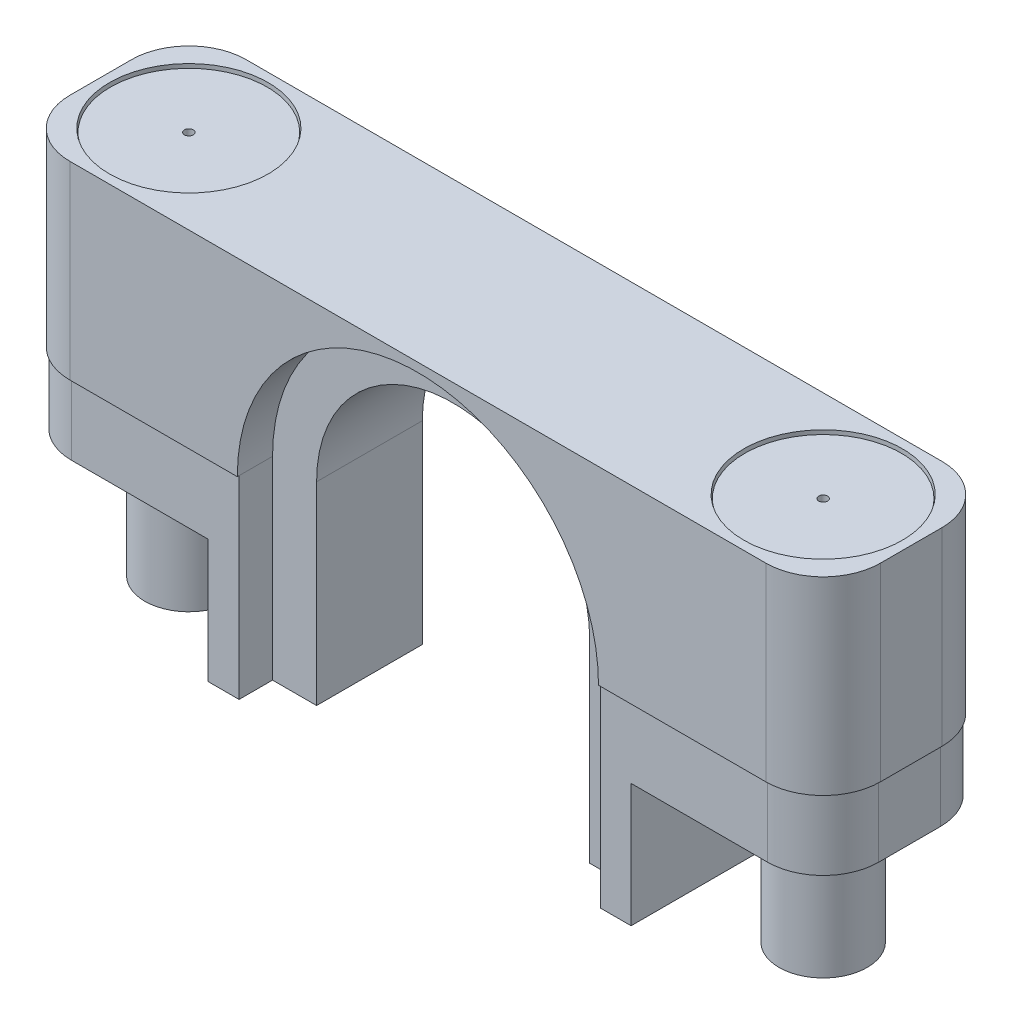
ISO-10303-21;
HEADER;
FILE_DESCRIPTION(('STEP AP214'),'2;1');
FILE_NAME('part.step','',(''),(''),'','','');
FILE_SCHEMA(('AUTOMOTIVE_DESIGN { 1 0 10303 214 1 1 1 1 }'));
ENDSEC;
DATA;
#1=APPLICATION_CONTEXT('core data for automotive mechanical design processes');
#2=APPLICATION_PROTOCOL_DEFINITION('international standard','automotive_design',2000,#1);
#3=PRODUCT_CONTEXT('',#1,'mechanical');
#4=PRODUCT('Part','Part','',(#3));
#5=PRODUCT_RELATED_PRODUCT_CATEGORY('part','',(#4));
#6=PRODUCT_DEFINITION_FORMATION('','',#4);
#7=PRODUCT_DEFINITION_CONTEXT('part definition',#1,'design');
#8=PRODUCT_DEFINITION('design','',#6,#7);
#9=PRODUCT_DEFINITION_SHAPE('','',#8);
#10=(LENGTH_UNIT() NAMED_UNIT(*) SI_UNIT(.MILLI.,.METRE.));
#11=(NAMED_UNIT(*) PLANE_ANGLE_UNIT() SI_UNIT($,.RADIAN.));
#12=(NAMED_UNIT(*) SI_UNIT($,.STERADIAN.) SOLID_ANGLE_UNIT());
#13=UNCERTAINTY_MEASURE_WITH_UNIT(LENGTH_MEASURE(1.E-05),#10,'distance_accuracy_value','');
#14=(GEOMETRIC_REPRESENTATION_CONTEXT(3) GLOBAL_UNCERTAINTY_ASSIGNED_CONTEXT((#13)) GLOBAL_UNIT_ASSIGNED_CONTEXT((#10,
#11,#12)) REPRESENTATION_CONTEXT('',''));
#15=CARTESIAN_POINT('',(0.,0.,0.));
#16=DIRECTION('',(0.,0.,1.));
#17=DIRECTION('',(1.,0.,0.));
#18=AXIS2_PLACEMENT_3D('',#15,#16,#17);
#19=CARTESIAN_POINT('',(-36.,11.55,0.));
#20=DIRECTION('',(0.,1.,0.));
#21=DIRECTION('',(0.,0.,1.));
#22=AXIS2_PLACEMENT_3D('',#19,#20,#21);
#23=CYLINDRICAL_SURFACE('',#22,9.);
#24=CARTESIAN_POINT('',(-36.,13.3623105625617,0.));
#25=DIRECTION('',(0.,-1.,0.));
#26=DIRECTION('',(0.,0.,-1.));
#27=AXIS2_PLACEMENT_3D('',#24,#25,#26);
#28=CIRCLE('',#27,9.);
#29=CARTESIAN_POINT('',(-36.,13.3623105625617,-9.00000000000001));
#30=VERTEX_POINT('',#29);
#31=EDGE_CURVE('E849',#30,#30,#28,.T.);
#32=ORIENTED_EDGE('',*,*,#31,.T.);
#33=EDGE_LOOP('',(#32));
#34=FACE_BOUND('',#33,.T.);
#35=CARTESIAN_POINT('',(-36.,14.75,0.));
#36=DIRECTION('',(0.,1.,0.));
#37=DIRECTION('',(0.,0.,1.));
#38=AXIS2_PLACEMENT_3D('',#35,#36,#37);
#39=CIRCLE('',#38,9.);
#40=CARTESIAN_POINT('',(-36.,14.75,9.));
#41=VERTEX_POINT('',#40);
#42=EDGE_CURVE('E806',#41,#41,#39,.T.);
#43=ORIENTED_EDGE('',*,*,#42,.T.);
#44=EDGE_LOOP('',(#43));
#45=FACE_BOUND('',#44,.T.);
#46=ADVANCED_FACE('F18',(#34,#45),#23,.F.);
#47=CARTESIAN_POINT('',(36.,11.55,0.));
#48=DIRECTION('',(0.,1.,0.));
#49=DIRECTION('',(0.,0.,1.));
#50=AXIS2_PLACEMENT_3D('',#47,#48,#49);
#51=CYLINDRICAL_SURFACE('',#50,9.);
#52=CARTESIAN_POINT('',(36.,13.3623105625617,0.));
#53=DIRECTION('',(0.,-1.,0.));
#54=DIRECTION('',(0.,0.,-1.));
#55=AXIS2_PLACEMENT_3D('',#52,#53,#54);
#56=CIRCLE('',#55,9.);
#57=CARTESIAN_POINT('',(36.,13.3623105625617,-9.00000000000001));
#58=VERTEX_POINT('',#57);
#59=EDGE_CURVE('E840',#58,#58,#56,.T.);
#60=ORIENTED_EDGE('',*,*,#59,.T.);
#61=EDGE_LOOP('',(#60));
#62=FACE_BOUND('',#61,.T.);
#63=CARTESIAN_POINT('',(36.,14.75,0.));
#64=DIRECTION('',(0.,1.,0.));
#65=DIRECTION('',(0.,0.,1.));
#66=AXIS2_PLACEMENT_3D('',#63,#64,#65);
#67=CIRCLE('',#66,9.);
#68=CARTESIAN_POINT('',(36.,14.75,9.));
#69=VERTEX_POINT('',#68);
#70=EDGE_CURVE('E811',#69,#69,#67,.T.);
#71=ORIENTED_EDGE('',*,*,#70,.T.);
#72=EDGE_LOOP('',(#71));
#73=FACE_BOUND('',#72,.T.);
#74=ADVANCED_FACE('F942',(#62,#73),#51,.F.);
#75=CARTESIAN_POINT('',(0.,0.,10.));
#76=DIRECTION('',(0.,0.,1.));
#77=DIRECTION('',(1.,0.,0.));
#78=AXIS2_PLACEMENT_3D('',#75,#76,#77);
#79=PLANE('',#78);
#80=DIRECTION('',(0.,1.,0.));
#81=VECTOR('',#80,1.);
#82=CARTESIAN_POINT('',(39.5,0.,10.));
#83=LINE('',#82,#81);
#84=CARTESIAN_POINT('',(39.5,-6.75,10.));
#85=VERTEX_POINT('',#84);
#86=CARTESIAN_POINT('',(39.5,14.75,10.));
#87=VERTEX_POINT('',#86);
#88=EDGE_CURVE('E410',#85,#87,#83,.T.);
#89=ORIENTED_EDGE('',*,*,#88,.T.);
#90=DIRECTION('',(-1.,0.,0.));
#91=VECTOR('',#90,1.);
#92=CARTESIAN_POINT('',(0.,14.75,10.));
#93=LINE('',#92,#91);
#94=CARTESIAN_POINT('',(-39.5,14.75,10.));
#95=VERTEX_POINT('',#94);
#96=EDGE_CURVE('E835',#87,#95,#93,.T.);
#97=ORIENTED_EDGE('',*,*,#96,.T.);
#98=DIRECTION('',(0.,1.,0.));
#99=VECTOR('',#98,1.);
#100=CARTESIAN_POINT('',(-39.5,0.,10.));
#101=LINE('',#100,#99);
#102=CARTESIAN_POINT('',(-39.5,-6.75,10.));
#103=VERTEX_POINT('',#102);
#104=EDGE_CURVE('E407',#95,#103,#101,.F.);
#105=ORIENTED_EDGE('',*,*,#104,.T.);
#106=DIRECTION('',(1.,0.,0.));
#107=VECTOR('',#106,1.);
#108=CARTESIAN_POINT('',(0.,-6.75,10.));
#109=LINE('',#108,#107);
#110=CARTESIAN_POINT('',(-20.5,-6.75,10.));
#111=VERTEX_POINT('',#110);
#112=EDGE_CURVE('E409',#103,#111,#109,.T.);
#113=ORIENTED_EDGE('',*,*,#112,.T.);
#114=CARTESIAN_POINT('',(0.,-6.75,10.));
#115=DIRECTION('',(0.,0.,1.));
#116=DIRECTION('',(1.,0.,0.));
#117=AXIS2_PLACEMENT_3D('',#114,#115,#116);
#118=CIRCLE('',#117,20.5);
#119=CARTESIAN_POINT('',(20.5,-6.75,10.));
#120=VERTEX_POINT('',#119);
#121=EDGE_CURVE('E637',#120,#111,#118,.T.);
#122=ORIENTED_EDGE('',*,*,#121,.F.);
#123=DIRECTION('',(1.,0.,0.));
#124=VECTOR('',#123,1.);
#125=CARTESIAN_POINT('',(0.,-6.75,10.));
#126=LINE('',#125,#124);
#127=EDGE_CURVE('E413',#120,#85,#126,.T.);
#128=ORIENTED_EDGE('',*,*,#127,.T.);
#129=EDGE_LOOP('',(#89,#97,#105,#113,#122,#128));
#130=FACE_BOUND('',#129,.T.);
#131=ADVANCED_FACE('F949',(#130),#79,.T.);
#132=CARTESIAN_POINT('',(-39.5,0.,3.5));
#133=DIRECTION('',(0.,-1.,0.));
#134=DIRECTION('',(1.,0.,0.));
#135=AXIS2_PLACEMENT_3D('',#132,#133,#134);
#136=CYLINDRICAL_SURFACE('',#135,6.5);
#137=ORIENTED_EDGE('',*,*,#104,.F.);
#138=CARTESIAN_POINT('',(-39.5,14.75,3.5));
#139=DIRECTION('',(0.,1.,0.));
#140=DIRECTION('',(0.,0.,1.));
#141=AXIS2_PLACEMENT_3D('',#138,#139,#140);
#142=CIRCLE('',#141,6.5);
#143=CARTESIAN_POINT('',(-46.,14.75,3.5));
#144=VERTEX_POINT('',#143);
#145=EDGE_CURVE('E34',#95,#144,#142,.F.);
#146=ORIENTED_EDGE('',*,*,#145,.T.);
#147=DIRECTION('',(0.,-1.,0.));
#148=VECTOR('',#147,1.);
#149=CARTESIAN_POINT('',(-46.,0.,3.5));
#150=LINE('',#149,#148);
#151=CARTESIAN_POINT('',(-46.,-6.75,3.5));
#152=VERTEX_POINT('',#151);
#153=EDGE_CURVE('E439',#144,#152,#150,.T.);
#154=ORIENTED_EDGE('',*,*,#153,.T.);
#155=CARTESIAN_POINT('',(-39.5,-6.75,3.5));
#156=DIRECTION('',(0.,-1.,0.));
#157=DIRECTION('',(1.,0.,0.));
#158=AXIS2_PLACEMENT_3D('',#155,#156,#157);
#159=CIRCLE('',#158,6.5);
#160=EDGE_CURVE('E426',#103,#152,#159,.T.);
#161=ORIENTED_EDGE('',*,*,#160,.F.);
#162=EDGE_LOOP('',(#137,#146,#154,#161));
#163=FACE_BOUND('',#162,.T.);
#164=ADVANCED_FACE('F1005',(#163),#136,.T.);
#165=CARTESIAN_POINT('',(-46.,14.75,-10.));
#166=DIRECTION('',(-1.,0.,0.));
#167=DIRECTION('',(0.,-1.,0.));
#168=AXIS2_PLACEMENT_3D('',#165,#166,#167);
#169=PLANE('',#168);
#170=ORIENTED_EDGE('',*,*,#153,.F.);
#171=DIRECTION('',(0.,0.,-1.));
#172=VECTOR('',#171,1.);
#173=CARTESIAN_POINT('',(-46.,14.75,-10.));
#174=LINE('',#173,#172);
#175=CARTESIAN_POINT('',(-46.,14.75,-3.5));
#176=VERTEX_POINT('',#175);
#177=EDGE_CURVE('E39',#144,#176,#174,.T.);
#178=ORIENTED_EDGE('',*,*,#177,.T.);
#179=DIRECTION('',(0.,1.,0.));
#180=VECTOR('',#179,1.);
#181=CARTESIAN_POINT('',(-46.,14.75,-3.5));
#182=LINE('',#181,#180);
#183=CARTESIAN_POINT('',(-46.,-6.75,-3.5));
#184=VERTEX_POINT('',#183);
#185=EDGE_CURVE('E460',#184,#176,#182,.T.);
#186=ORIENTED_EDGE('',*,*,#185,.F.);
#187=DIRECTION('',(0.,0.,-1.));
#188=VECTOR('',#187,1.);
#189=CARTESIAN_POINT('',(-46.,-6.75,0.));
#190=LINE('',#189,#188);
#191=EDGE_CURVE('E422',#152,#184,#190,.T.);
#192=ORIENTED_EDGE('',*,*,#191,.F.);
#193=EDGE_LOOP('',(#170,#178,#186,#192));
#194=FACE_BOUND('',#193,.T.);
#195=ADVANCED_FACE('F1001',(#194),#169,.T.);
#196=CARTESIAN_POINT('',(-39.5,14.75,-3.5));
#197=DIRECTION('',(0.,1.,0.));
#198=DIRECTION('',(-1.,0.,0.));
#199=AXIS2_PLACEMENT_3D('',#196,#197,#198);
#200=CYLINDRICAL_SURFACE('',#199,6.5);
#201=ORIENTED_EDGE('',*,*,#185,.T.);
#202=CARTESIAN_POINT('',(-39.5,14.75,-3.5));
#203=DIRECTION('',(0.,1.,0.));
#204=DIRECTION('',(0.,0.,1.));
#205=AXIS2_PLACEMENT_3D('',#202,#203,#204);
#206=CIRCLE('',#205,6.5);
#207=CARTESIAN_POINT('',(-39.5,14.75,-10.));
#208=VERTEX_POINT('',#207);
#209=EDGE_CURVE('E830',#176,#208,#206,.F.);
#210=ORIENTED_EDGE('',*,*,#209,.T.);
#211=DIRECTION('',(0.,1.,0.));
#212=VECTOR('',#211,1.);
#213=CARTESIAN_POINT('',(-39.5,0.,-10.));
#214=LINE('',#213,#212);
#215=CARTESIAN_POINT('',(-39.5,-6.75,-10.));
#216=VERTEX_POINT('',#215);
#217=EDGE_CURVE('E414',#208,#216,#214,.F.);
#218=ORIENTED_EDGE('',*,*,#217,.T.);
#219=CARTESIAN_POINT('',(-39.5,-6.75,-3.5));
#220=DIRECTION('',(0.,1.,0.));
#221=DIRECTION('',(-1.,0.,0.));
#222=AXIS2_PLACEMENT_3D('',#219,#220,#221);
#223=CIRCLE('',#222,6.5);
#224=EDGE_CURVE('E425',#184,#216,#223,.F.);
#225=ORIENTED_EDGE('',*,*,#224,.F.);
#226=EDGE_LOOP('',(#201,#210,#218,#225));
#227=FACE_BOUND('',#226,.T.);
#228=ADVANCED_FACE('F997',(#227),#200,.T.);
#229=CARTESIAN_POINT('',(0.,0.,-10.));
#230=DIRECTION('',(0.,0.,1.));
#231=DIRECTION('',(1.,0.,0.));
#232=AXIS2_PLACEMENT_3D('',#229,#230,#231);
#233=PLANE('',#232);
#234=DIRECTION('',(-1.,0.,0.));
#235=VECTOR('',#234,1.);
#236=CARTESIAN_POINT('',(0.,14.75,-10.));
#237=LINE('',#236,#235);
#238=CARTESIAN_POINT('',(39.5,14.75,-10.));
#239=VERTEX_POINT('',#238);
#240=EDGE_CURVE('E828',#239,#208,#237,.T.);
#241=ORIENTED_EDGE('',*,*,#240,.F.);
#242=DIRECTION('',(0.,1.,0.));
#243=VECTOR('',#242,1.);
#244=CARTESIAN_POINT('',(39.5,0.,-10.));
#245=LINE('',#244,#243);
#246=CARTESIAN_POINT('',(39.5,-6.75,-10.));
#247=VERTEX_POINT('',#246);
#248=EDGE_CURVE('E418',#247,#239,#245,.T.);
#249=ORIENTED_EDGE('',*,*,#248,.F.);
#250=DIRECTION('',(1.,0.,0.));
#251=VECTOR('',#250,1.);
#252=CARTESIAN_POINT('',(0.,-6.75,-10.));
#253=LINE('',#252,#251);
#254=CARTESIAN_POINT('',(20.5,-6.75,-10.));
#255=VERTEX_POINT('',#254);
#256=EDGE_CURVE('E417',#255,#247,#253,.T.);
#257=ORIENTED_EDGE('',*,*,#256,.F.);
#258=CARTESIAN_POINT('',(0.,-6.75,-10.));
#259=DIRECTION('',(0.,0.,1.));
#260=DIRECTION('',(1.,0.,0.));
#261=AXIS2_PLACEMENT_3D('',#258,#259,#260);
#262=CIRCLE('',#261,20.5);
#263=CARTESIAN_POINT('',(-20.5,-6.75,-10.));
#264=VERTEX_POINT('',#263);
#265=EDGE_CURVE('E625',#264,#255,#262,.F.);
#266=ORIENTED_EDGE('',*,*,#265,.F.);
#267=DIRECTION('',(1.,0.,0.));
#268=VECTOR('',#267,1.);
#269=CARTESIAN_POINT('',(0.,-6.75,-10.));
#270=LINE('',#269,#268);
#271=EDGE_CURVE('E416',#216,#264,#270,.T.);
#272=ORIENTED_EDGE('',*,*,#271,.F.);
#273=ORIENTED_EDGE('',*,*,#217,.F.);
#274=EDGE_LOOP('',(#241,#249,#257,#266,#272,#273));
#275=FACE_BOUND('',#274,.T.);
#276=ADVANCED_FACE('F993',(#275),#233,.F.);
#277=CARTESIAN_POINT('',(39.5,14.75,-3.5));
#278=DIRECTION('',(0.,-1.,0.));
#279=DIRECTION('',(0.,0.,-1.));
#280=AXIS2_PLACEMENT_3D('',#277,#278,#279);
#281=CYLINDRICAL_SURFACE('',#280,6.5);
#282=ORIENTED_EDGE('',*,*,#248,.T.);
#283=CARTESIAN_POINT('',(39.5,14.75,-3.5));
#284=DIRECTION('',(0.,1.,0.));
#285=DIRECTION('',(0.,0.,1.));
#286=AXIS2_PLACEMENT_3D('',#283,#284,#285);
#287=CIRCLE('',#286,6.5);
#288=CARTESIAN_POINT('',(46.,14.75,-3.5));
#289=VERTEX_POINT('',#288);
#290=EDGE_CURVE('E825',#239,#289,#287,.F.);
#291=ORIENTED_EDGE('',*,*,#290,.T.);
#292=DIRECTION('',(0.,-1.,0.));
#293=VECTOR('',#292,1.);
#294=CARTESIAN_POINT('',(46.,14.75,-3.5));
#295=LINE('',#294,#293);
#296=CARTESIAN_POINT('',(46.,-6.75,-3.5));
#297=VERTEX_POINT('',#296);
#298=EDGE_CURVE('E464',#289,#297,#295,.T.);
#299=ORIENTED_EDGE('',*,*,#298,.T.);
#300=CARTESIAN_POINT('',(39.5,-6.75,-3.5));
#301=DIRECTION('',(0.,-1.,0.));
#302=DIRECTION('',(0.,0.,-1.));
#303=AXIS2_PLACEMENT_3D('',#300,#301,#302);
#304=CIRCLE('',#303,6.5);
#305=EDGE_CURVE('E459',#247,#297,#304,.T.);
#306=ORIENTED_EDGE('',*,*,#305,.F.);
#307=EDGE_LOOP('',(#282,#291,#299,#306));
#308=FACE_BOUND('',#307,.T.);
#309=ADVANCED_FACE('F989',(#308),#281,.T.);
#310=CARTESIAN_POINT('',(46.,14.75,-10.));
#311=DIRECTION('',(1.,0.,0.));
#312=DIRECTION('',(0.,0.,-1.));
#313=AXIS2_PLACEMENT_3D('',#310,#311,#312);
#314=PLANE('',#313);
#315=ORIENTED_EDGE('',*,*,#298,.F.);
#316=DIRECTION('',(0.,0.,1.));
#317=VECTOR('',#316,1.);
#318=CARTESIAN_POINT('',(46.,14.75,-10.));
#319=LINE('',#318,#317);
#320=CARTESIAN_POINT('',(46.,14.75,3.5));
#321=VERTEX_POINT('',#320);
#322=EDGE_CURVE('E823',#289,#321,#319,.T.);
#323=ORIENTED_EDGE('',*,*,#322,.T.);
#324=DIRECTION('',(0.,1.,0.));
#325=VECTOR('',#324,1.);
#326=CARTESIAN_POINT('',(46.,0.,3.5));
#327=LINE('',#326,#325);
#328=CARTESIAN_POINT('',(46.,-6.75,3.5));
#329=VERTEX_POINT('',#328);
#330=EDGE_CURVE('E466',#329,#321,#327,.T.);
#331=ORIENTED_EDGE('',*,*,#330,.F.);
#332=DIRECTION('',(0.,0.,-1.));
#333=VECTOR('',#332,1.);
#334=CARTESIAN_POINT('',(46.,-6.75,0.));
#335=LINE('',#334,#333);
#336=EDGE_CURVE('E455',#297,#329,#335,.F.);
#337=ORIENTED_EDGE('',*,*,#336,.F.);
#338=EDGE_LOOP('',(#315,#323,#331,#337));
#339=FACE_BOUND('',#338,.T.);
#340=ADVANCED_FACE('F992',(#339),#314,.T.);
#341=CARTESIAN_POINT('',(39.5,0.,3.5));
#342=DIRECTION('',(0.,1.,0.));
#343=DIRECTION('',(0.,0.,1.));
#344=AXIS2_PLACEMENT_3D('',#341,#342,#343);
#345=CYLINDRICAL_SURFACE('',#344,6.5);
#346=ORIENTED_EDGE('',*,*,#330,.T.);
#347=CARTESIAN_POINT('',(39.5,14.75,3.5));
#348=DIRECTION('',(0.,1.,0.));
#349=DIRECTION('',(0.,0.,1.));
#350=AXIS2_PLACEMENT_3D('',#347,#348,#349);
#351=CIRCLE('',#350,6.5);
#352=EDGE_CURVE('E820',#321,#87,#351,.F.);
#353=ORIENTED_EDGE('',*,*,#352,.T.);
#354=ORIENTED_EDGE('',*,*,#88,.F.);
#355=CARTESIAN_POINT('',(39.5,-6.75,3.5));
#356=DIRECTION('',(0.,1.,0.));
#357=DIRECTION('',(0.,0.,1.));
#358=AXIS2_PLACEMENT_3D('',#355,#356,#357);
#359=CIRCLE('',#358,6.5);
#360=EDGE_CURVE('E444',#85,#329,#359,.T.);
#361=ORIENTED_EDGE('',*,*,#360,.T.);
#362=EDGE_LOOP('',(#346,#353,#354,#361));
#363=FACE_BOUND('',#362,.T.);
#364=ADVANCED_FACE('F1013',(#363),#345,.T.);
#365=CARTESIAN_POINT('',(-15.5,-30.9367875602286,10.));
#366=DIRECTION('',(-1.,0.,0.));
#367=DIRECTION('',(0.,0.,1.));
#368=AXIS2_PLACEMENT_3D('',#365,#366,#367);
#369=PLANE('',#368);
#370=DIRECTION('',(0.,1.,0.));
#371=VECTOR('',#370,1.);
#372=CARTESIAN_POINT('',(-15.5,-30.9367875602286,6.));
#373=LINE('',#372,#371);
#374=CARTESIAN_POINT('',(-15.5,-28.75,6.));
#375=VERTEX_POINT('',#374);
#376=CARTESIAN_POINT('',(-15.5,-6.75,6.));
#377=VERTEX_POINT('',#376);
#378=EDGE_CURVE('E607',#375,#377,#373,.T.);
#379=ORIENTED_EDGE('',*,*,#378,.F.);
#380=DIRECTION('',(0.,0.,1.));
#381=VECTOR('',#380,1.);
#382=CARTESIAN_POINT('',(-15.5,-28.75,10.));
#383=LINE('',#382,#381);
#384=CARTESIAN_POINT('',(-15.5,-28.75,-6.));
#385=VERTEX_POINT('',#384);
#386=EDGE_CURVE('E640',#385,#375,#383,.T.);
#387=ORIENTED_EDGE('',*,*,#386,.F.);
#388=DIRECTION('',(0.,1.,0.));
#389=VECTOR('',#388,1.);
#390=CARTESIAN_POINT('',(-15.5,-33.5295457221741,-6.));
#391=LINE('',#390,#389);
#392=CARTESIAN_POINT('',(-15.5,-6.75,-6.));
#393=VERTEX_POINT('',#392);
#394=EDGE_CURVE('E589',#385,#393,#391,.T.);
#395=ORIENTED_EDGE('',*,*,#394,.T.);
#396=DIRECTION('',(0.,0.,-1.));
#397=VECTOR('',#396,1.);
#398=CARTESIAN_POINT('',(-15.5,-6.75,10.));
#399=LINE('',#398,#397);
#400=EDGE_CURVE('E406',#393,#377,#399,.F.);
#401=ORIENTED_EDGE('',*,*,#400,.T.);
#402=EDGE_LOOP('',(#379,#387,#395,#401));
#403=FACE_BOUND('',#402,.T.);
#404=ADVANCED_FACE('F1015',(#403),#369,.F.);
#405=CARTESIAN_POINT('',(0.,-6.75,10.));
#406=DIRECTION('',(0.,0.,-1.));
#407=DIRECTION('',(-1.,0.,0.));
#408=AXIS2_PLACEMENT_3D('',#405,#406,#407);
#409=CYLINDRICAL_SURFACE('',#408,15.5);
#410=ORIENTED_EDGE('',*,*,#400,.F.);
#411=CARTESIAN_POINT('',(0.,-6.75,-6.));
#412=DIRECTION('',(0.,0.,-1.));
#413=DIRECTION('',(-1.,0.,0.));
#414=AXIS2_PLACEMENT_3D('',#411,#412,#413);
#415=CIRCLE('',#414,15.5);
#416=CARTESIAN_POINT('',(15.5,-6.75,-6.));
#417=VERTEX_POINT('',#416);
#418=EDGE_CURVE('E595',#393,#417,#415,.T.);
#419=ORIENTED_EDGE('',*,*,#418,.T.);
#420=DIRECTION('',(0.,0.,-1.));
#421=VECTOR('',#420,1.);
#422=CARTESIAN_POINT('',(15.5,-6.75,10.));
#423=LINE('',#422,#421);
#424=CARTESIAN_POINT('',(15.5,-6.75,6.));
#425=VERTEX_POINT('',#424);
#426=EDGE_CURVE('E549',#417,#425,#423,.F.);
#427=ORIENTED_EDGE('',*,*,#426,.T.);
#428=CARTESIAN_POINT('',(0.,-6.75,6.));
#429=DIRECTION('',(0.,0.,1.));
#430=DIRECTION('',(1.,0.,0.));
#431=AXIS2_PLACEMENT_3D('',#428,#429,#430);
#432=CIRCLE('',#431,15.5);
#433=EDGE_CURVE('E612',#425,#377,#432,.T.);
#434=ORIENTED_EDGE('',*,*,#433,.T.);
#435=EDGE_LOOP('',(#410,#419,#427,#434));
#436=FACE_BOUND('',#435,.T.);
#437=ADVANCED_FACE('F1154',(#436),#409,.F.);
#438=CARTESIAN_POINT('',(15.5,-30.9367875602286,10.));
#439=DIRECTION('',(1.,0.,0.));
#440=DIRECTION('',(0.,0.,-1.));
#441=AXIS2_PLACEMENT_3D('',#438,#439,#440);
#442=PLANE('',#441);
#443=ORIENTED_EDGE('',*,*,#426,.F.);
#444=DIRECTION('',(0.,1.,0.));
#445=VECTOR('',#444,1.);
#446=CARTESIAN_POINT('',(15.5,-30.9367875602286,-6.));
#447=LINE('',#446,#445);
#448=CARTESIAN_POINT('',(15.5,-28.75,-6.));
#449=VERTEX_POINT('',#448);
#450=EDGE_CURVE('E592',#449,#417,#447,.T.);
#451=ORIENTED_EDGE('',*,*,#450,.F.);
#452=DIRECTION('',(0.,0.,1.));
#453=VECTOR('',#452,1.);
#454=CARTESIAN_POINT('',(15.5,-28.75,0.));
#455=LINE('',#454,#453);
#456=CARTESIAN_POINT('',(15.5,-28.75,6.));
#457=VERTEX_POINT('',#456);
#458=EDGE_CURVE('E654',#449,#457,#455,.T.);
#459=ORIENTED_EDGE('',*,*,#458,.T.);
#460=DIRECTION('',(0.,1.,0.));
#461=VECTOR('',#460,1.);
#462=CARTESIAN_POINT('',(15.5,-32.7022472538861,6.));
#463=LINE('',#462,#461);
#464=EDGE_CURVE('E598',#457,#425,#463,.T.);
#465=ORIENTED_EDGE('',*,*,#464,.T.);
#466=EDGE_LOOP('',(#443,#451,#459,#465));
#467=FACE_BOUND('',#466,.T.);
#468=ADVANCED_FACE('F1150',(#467),#442,.F.);
#469=CARTESIAN_POINT('',(24.,-28.75,10.));
#470=DIRECTION('',(-1.,0.,0.));
#471=DIRECTION('',(0.,0.,1.));
#472=AXIS2_PLACEMENT_3D('',#469,#470,#471);
#473=PLANE('',#472);
#474=DIRECTION('',(0.,0.,-1.));
#475=VECTOR('',#474,1.);
#476=CARTESIAN_POINT('',(24.,-14.75,-10.));
#477=LINE('',#476,#475);
#478=CARTESIAN_POINT('',(24.,-14.75,9.8));
#479=VERTEX_POINT('',#478);
#480=CARTESIAN_POINT('',(24.,-14.75,-9.8));
#481=VERTEX_POINT('',#480);
#482=EDGE_CURVE('E545',#479,#481,#477,.T.);
#483=ORIENTED_EDGE('',*,*,#482,.F.);
#484=DIRECTION('',(0.,1.,0.));
#485=VECTOR('',#484,1.);
#486=CARTESIAN_POINT('',(24.,-28.75,9.8));
#487=LINE('',#486,#485);
#488=CARTESIAN_POINT('',(24.,-28.75,9.8));
#489=VERTEX_POINT('',#488);
#490=EDGE_CURVE('E736',#489,#479,#487,.T.);
#491=ORIENTED_EDGE('',*,*,#490,.F.);
#492=DIRECTION('',(0.,0.,-1.));
#493=VECTOR('',#492,1.);
#494=CARTESIAN_POINT('',(24.,-28.75,0.));
#495=LINE('',#494,#493);
#496=CARTESIAN_POINT('',(24.,-28.75,-9.8));
#497=VERTEX_POINT('',#496);
#498=EDGE_CURVE('E664',#489,#497,#495,.T.);
#499=ORIENTED_EDGE('',*,*,#498,.T.);
#500=DIRECTION('',(0.,1.,0.));
#501=VECTOR('',#500,1.);
#502=CARTESIAN_POINT('',(24.,88.3403065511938,-9.8));
#503=LINE('',#502,#501);
#504=EDGE_CURVE('E741',#497,#481,#503,.T.);
#505=ORIENTED_EDGE('',*,*,#504,.T.);
#506=EDGE_LOOP('',(#483,#491,#499,#505));
#507=FACE_BOUND('',#506,.T.);
#508=ADVANCED_FACE('F1146',(#507),#473,.F.);
#509=CARTESIAN_POINT('',(0.,-28.75,0.));
#510=DIRECTION('',(0.,-1.,0.));
#511=DIRECTION('',(0.,0.,-1.));
#512=AXIS2_PLACEMENT_3D('',#509,#510,#511);
#513=PLANE('',#512);
#514=DIRECTION('',(1.,0.,0.));
#515=VECTOR('',#514,1.);
#516=CARTESIAN_POINT('',(0.,-28.75,-6.));
#517=LINE('',#516,#515);
#518=CARTESIAN_POINT('',(20.5,-28.75,-6.));
#519=VERTEX_POINT('',#518);
#520=EDGE_CURVE('E711',#519,#449,#517,.F.);
#521=ORIENTED_EDGE('',*,*,#520,.F.);
#522=DIRECTION('',(0.,0.,-1.));
#523=VECTOR('',#522,1.);
#524=CARTESIAN_POINT('',(20.5,-28.75,-6.));
#525=LINE('',#524,#523);
#526=CARTESIAN_POINT('',(20.5,-28.75,-9.8));
#527=VERTEX_POINT('',#526);
#528=EDGE_CURVE('E659',#519,#527,#525,.T.);
#529=ORIENTED_EDGE('',*,*,#528,.T.);
#530=DIRECTION('',(-1.,0.,0.));
#531=VECTOR('',#530,1.);
#532=CARTESIAN_POINT('',(39.5,-28.75,-9.8));
#533=LINE('',#532,#531);
#534=EDGE_CURVE('E678',#527,#497,#533,.F.);
#535=ORIENTED_EDGE('',*,*,#534,.T.);
#536=ORIENTED_EDGE('',*,*,#498,.F.);
#537=DIRECTION('',(1.,0.,0.));
#538=VECTOR('',#537,1.);
#539=CARTESIAN_POINT('',(23.7,-28.75,9.8));
#540=LINE('',#539,#538);
#541=CARTESIAN_POINT('',(20.5,-28.75,9.8));
#542=VERTEX_POINT('',#541);
#543=EDGE_CURVE('E683',#489,#542,#540,.F.);
#544=ORIENTED_EDGE('',*,*,#543,.T.);
#545=DIRECTION('',(0.,0.,1.));
#546=VECTOR('',#545,1.);
#547=CARTESIAN_POINT('',(20.5,-28.75,0.));
#548=LINE('',#547,#546);
#549=CARTESIAN_POINT('',(20.5,-28.75,6.));
#550=VERTEX_POINT('',#549);
#551=EDGE_CURVE('E668',#550,#542,#548,.T.);
#552=ORIENTED_EDGE('',*,*,#551,.F.);
#553=DIRECTION('',(1.,0.,0.));
#554=VECTOR('',#553,1.);
#555=CARTESIAN_POINT('',(0.,-28.75,6.));
#556=LINE('',#555,#554);
#557=EDGE_CURVE('E687',#550,#457,#556,.F.);
#558=ORIENTED_EDGE('',*,*,#557,.T.);
#559=ORIENTED_EDGE('',*,*,#458,.F.);
#560=EDGE_LOOP('',(#521,#529,#535,#536,#544,#552,#558,#559));
#561=FACE_BOUND('',#560,.T.);
#562=ADVANCED_FACE('F1142',(#561),#513,.T.);
#563=CARTESIAN_POINT('',(-46.,-14.75,-10.));
#564=DIRECTION('',(0.,-1.,0.));
#565=DIRECTION('',(0.,0.,-1.));
#566=AXIS2_PLACEMENT_3D('',#563,#564,#565);
#567=PLANE('',#566);
#568=CARTESIAN_POINT('',(36.,-14.75,0.));
#569=DIRECTION('',(0.,-1.,0.));
#570=DIRECTION('',(0.,0.,-1.));
#571=AXIS2_PLACEMENT_3D('',#568,#569,#570);
#572=CIRCLE('',#571,5.5);
#573=CARTESIAN_POINT('',(36.,-14.75,-5.5));
#574=VERTEX_POINT('',#573);
#575=EDGE_CURVE('E814',#574,#574,#572,.T.);
#576=ORIENTED_EDGE('',*,*,#575,.F.);
#577=EDGE_LOOP('',(#576));
#578=FACE_BOUND('',#577,.T.);
#579=DIRECTION('',(-1.,0.,0.));
#580=VECTOR('',#579,1.);
#581=CARTESIAN_POINT('',(-46.,-14.75,9.8));
#582=LINE('',#581,#580);
#583=CARTESIAN_POINT('',(39.5,-14.75,9.8));
#584=VERTEX_POINT('',#583);
#585=EDGE_CURVE('E751',#479,#584,#582,.F.);
#586=ORIENTED_EDGE('',*,*,#585,.F.);
#587=ORIENTED_EDGE('',*,*,#482,.T.);
#588=DIRECTION('',(-1.,0.,0.));
#589=VECTOR('',#588,1.);
#590=CARTESIAN_POINT('',(39.5,-14.75,-9.8));
#591=LINE('',#590,#589);
#592=CARTESIAN_POINT('',(39.5,-14.75,-9.8));
#593=VERTEX_POINT('',#592);
#594=EDGE_CURVE('E746',#481,#593,#591,.F.);
#595=ORIENTED_EDGE('',*,*,#594,.T.);
#596=CARTESIAN_POINT('',(39.5,-14.75,-3.5));
#597=DIRECTION('',(0.,-1.,0.));
#598=DIRECTION('',(0.,0.,-1.));
#599=AXIS2_PLACEMENT_3D('',#596,#597,#598);
#600=CIRCLE('',#599,6.3);
#601=CARTESIAN_POINT('',(45.8,-14.75,-3.5));
#602=VERTEX_POINT('',#601);
#603=EDGE_CURVE('E756',#593,#602,#600,.T.);
#604=ORIENTED_EDGE('',*,*,#603,.T.);
#605=DIRECTION('',(0.,0.,-1.));
#606=VECTOR('',#605,1.);
#607=CARTESIAN_POINT('',(45.8,-14.75,3.5));
#608=LINE('',#607,#606);
#609=CARTESIAN_POINT('',(45.8,-14.75,3.5));
#610=VERTEX_POINT('',#609);
#611=EDGE_CURVE('E761',#602,#610,#608,.F.);
#612=ORIENTED_EDGE('',*,*,#611,.T.);
#613=CARTESIAN_POINT('',(39.5,-14.75,3.5));
#614=DIRECTION('',(0.,-1.,0.));
#615=DIRECTION('',(0.,0.,-1.));
#616=AXIS2_PLACEMENT_3D('',#613,#614,#615);
#617=CIRCLE('',#616,6.3);
#618=EDGE_CURVE('E766',#584,#610,#617,.F.);
#619=ORIENTED_EDGE('',*,*,#618,.F.);
#620=EDGE_LOOP('',(#586,#587,#595,#604,#612,#619));
#621=FACE_BOUND('',#620,.T.);
#622=ADVANCED_FACE('F1139',(#578,#621),#567,.T.);
#623=CARTESIAN_POINT('',(-24.,-28.75,10.));
#624=DIRECTION('',(1.,0.,0.));
#625=DIRECTION('',(0.,0.,-1.));
#626=AXIS2_PLACEMENT_3D('',#623,#624,#625);
#627=PLANE('',#626);
#628=DIRECTION('',(0.,0.,1.));
#629=VECTOR('',#628,1.);
#630=CARTESIAN_POINT('',(-24.,-28.75,0.));
#631=LINE('',#630,#629);
#632=CARTESIAN_POINT('',(-24.,-28.75,-9.8));
#633=VERTEX_POINT('',#632);
#634=CARTESIAN_POINT('',(-24.,-28.75,9.8));
#635=VERTEX_POINT('',#634);
#636=EDGE_CURVE('E645',#633,#635,#631,.T.);
#637=ORIENTED_EDGE('',*,*,#636,.T.);
#638=DIRECTION('',(0.,1.,0.));
#639=VECTOR('',#638,1.);
#640=CARTESIAN_POINT('',(-24.,88.3403065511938,9.8));
#641=LINE('',#640,#639);
#642=CARTESIAN_POINT('',(-24.,-14.75,9.8));
#643=VERTEX_POINT('',#642);
#644=EDGE_CURVE('E776',#635,#643,#641,.T.);
#645=ORIENTED_EDGE('',*,*,#644,.T.);
#646=DIRECTION('',(0.,0.,-1.));
#647=VECTOR('',#646,1.);
#648=CARTESIAN_POINT('',(-24.,-14.75,-10.));
#649=LINE('',#648,#647);
#650=CARTESIAN_POINT('',(-24.,-14.75,-9.8));
#651=VERTEX_POINT('',#650);
#652=EDGE_CURVE('E536',#651,#643,#649,.F.);
#653=ORIENTED_EDGE('',*,*,#652,.F.);
#654=DIRECTION('',(0.,1.,0.));
#655=VECTOR('',#654,1.);
#656=CARTESIAN_POINT('',(-24.,-28.75,-9.8));
#657=LINE('',#656,#655);
#658=EDGE_CURVE('E771',#633,#651,#657,.T.);
#659=ORIENTED_EDGE('',*,*,#658,.F.);
#660=EDGE_LOOP('',(#637,#645,#653,#659));
#661=FACE_BOUND('',#660,.T.);
#662=ADVANCED_FACE('F1120',(#661),#627,.F.);
#663=CARTESIAN_POINT('',(0.,-28.75,0.));
#664=DIRECTION('',(0.,-1.,0.));
#665=DIRECTION('',(0.,0.,-1.));
#666=AXIS2_PLACEMENT_3D('',#663,#664,#665);
#667=PLANE('',#666);
#668=DIRECTION('',(0.,0.,-1.));
#669=VECTOR('',#668,1.);
#670=CARTESIAN_POINT('',(-20.5,-28.75,0.));
#671=LINE('',#670,#669);
#672=CARTESIAN_POINT('',(-20.5,-28.75,-6.));
#673=VERTEX_POINT('',#672);
#674=CARTESIAN_POINT('',(-20.5,-28.75,-9.8));
#675=VERTEX_POINT('',#674);
#676=EDGE_CURVE('E649',#673,#675,#671,.T.);
#677=ORIENTED_EDGE('',*,*,#676,.F.);
#678=DIRECTION('',(-1.,0.,0.));
#679=VECTOR('',#678,1.);
#680=CARTESIAN_POINT('',(0.,-28.75,-6.));
#681=LINE('',#680,#679);
#682=EDGE_CURVE('E706',#673,#385,#681,.F.);
#683=ORIENTED_EDGE('',*,*,#682,.T.);
#684=ORIENTED_EDGE('',*,*,#386,.T.);
#685=DIRECTION('',(-1.,0.,0.));
#686=VECTOR('',#685,1.);
#687=CARTESIAN_POINT('',(0.,-28.75,6.));
#688=LINE('',#687,#686);
#689=CARTESIAN_POINT('',(-20.5,-28.75,6.));
#690=VERTEX_POINT('',#689);
#691=EDGE_CURVE('E692',#690,#375,#688,.F.);
#692=ORIENTED_EDGE('',*,*,#691,.F.);
#693=DIRECTION('',(0.,0.,1.));
#694=VECTOR('',#693,1.);
#695=CARTESIAN_POINT('',(-20.5,-28.75,6.));
#696=LINE('',#695,#694);
#697=CARTESIAN_POINT('',(-20.5,-28.75,9.8));
#698=VERTEX_POINT('',#697);
#699=EDGE_CURVE('E673',#690,#698,#696,.T.);
#700=ORIENTED_EDGE('',*,*,#699,.T.);
#701=DIRECTION('',(1.,0.,0.));
#702=VECTOR('',#701,1.);
#703=CARTESIAN_POINT('',(23.7,-28.75,9.8));
#704=LINE('',#703,#702);
#705=EDGE_CURVE('E697',#698,#635,#704,.F.);
#706=ORIENTED_EDGE('',*,*,#705,.T.);
#707=ORIENTED_EDGE('',*,*,#636,.F.);
#708=DIRECTION('',(-1.,0.,0.));
#709=VECTOR('',#708,1.);
#710=CARTESIAN_POINT('',(39.5,-28.75,-9.8));
#711=LINE('',#710,#709);
#712=EDGE_CURVE('E702',#633,#675,#711,.F.);
#713=ORIENTED_EDGE('',*,*,#712,.T.);
#714=EDGE_LOOP('',(#677,#683,#684,#692,#700,#706,#707,#713));
#715=FACE_BOUND('',#714,.T.);
#716=ADVANCED_FACE('F1116',(#715),#667,.T.);
#717=CARTESIAN_POINT('',(-46.,-14.75,-10.));
#718=DIRECTION('',(0.,-1.,0.));
#719=DIRECTION('',(0.,0.,-1.));
#720=AXIS2_PLACEMENT_3D('',#717,#718,#719);
#721=PLANE('',#720);
#722=CARTESIAN_POINT('',(-36.,-14.75,0.));
#723=DIRECTION('',(0.,-1.,0.));
#724=DIRECTION('',(0.,0.,-1.));
#725=AXIS2_PLACEMENT_3D('',#722,#723,#724);
#726=CIRCLE('',#725,5.5);
#727=CARTESIAN_POINT('',(-36.,-14.75,-5.5));
#728=VERTEX_POINT('',#727);
#729=EDGE_CURVE('E817',#728,#728,#726,.T.);
#730=ORIENTED_EDGE('',*,*,#729,.F.);
#731=EDGE_LOOP('',(#730));
#732=FACE_BOUND('',#731,.T.);
#733=DIRECTION('',(1.,0.,0.));
#734=VECTOR('',#733,1.);
#735=CARTESIAN_POINT('',(-46.,-14.75,-9.8));
#736=LINE('',#735,#734);
#737=CARTESIAN_POINT('',(-39.5,-14.75,-9.8));
#738=VERTEX_POINT('',#737);
#739=EDGE_CURVE('E786',#651,#738,#736,.F.);
#740=ORIENTED_EDGE('',*,*,#739,.F.);
#741=ORIENTED_EDGE('',*,*,#652,.T.);
#742=DIRECTION('',(1.,0.,0.));
#743=VECTOR('',#742,1.);
#744=CARTESIAN_POINT('',(23.7,-14.75,9.8));
#745=LINE('',#744,#743);
#746=CARTESIAN_POINT('',(-39.5,-14.75,9.8));
#747=VERTEX_POINT('',#746);
#748=EDGE_CURVE('E781',#643,#747,#745,.F.);
#749=ORIENTED_EDGE('',*,*,#748,.T.);
#750=CARTESIAN_POINT('',(-39.5,-14.75,3.5));
#751=DIRECTION('',(0.,-1.,0.));
#752=DIRECTION('',(0.,0.,-1.));
#753=AXIS2_PLACEMENT_3D('',#750,#751,#752);
#754=CIRCLE('',#753,6.3);
#755=CARTESIAN_POINT('',(-45.8,-14.75,3.5));
#756=VERTEX_POINT('',#755);
#757=EDGE_CURVE('E791',#747,#756,#754,.T.);
#758=ORIENTED_EDGE('',*,*,#757,.T.);
#759=DIRECTION('',(0.,0.,1.));
#760=VECTOR('',#759,1.);
#761=CARTESIAN_POINT('',(-45.8,-14.75,3.5));
#762=LINE('',#761,#760);
#763=CARTESIAN_POINT('',(-45.8,-14.75,-3.5));
#764=VERTEX_POINT('',#763);
#765=EDGE_CURVE('E796',#756,#764,#762,.F.);
#766=ORIENTED_EDGE('',*,*,#765,.T.);
#767=CARTESIAN_POINT('',(-39.5,-14.75,-3.5));
#768=DIRECTION('',(0.,-1.,0.));
#769=DIRECTION('',(0.,0.,-1.));
#770=AXIS2_PLACEMENT_3D('',#767,#768,#769);
#771=CIRCLE('',#770,6.3);
#772=EDGE_CURVE('E801',#738,#764,#771,.F.);
#773=ORIENTED_EDGE('',*,*,#772,.F.);
#774=EDGE_LOOP('',(#740,#741,#749,#758,#766,#773));
#775=FACE_BOUND('',#774,.T.);
#776=ADVANCED_FACE('F1122',(#732,#775),#721,.T.);
#777=CARTESIAN_POINT('',(0.,-33.5295457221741,-6.));
#778=DIRECTION('',(0.,0.,-1.));
#779=DIRECTION('',(-1.,0.,0.));
#780=AXIS2_PLACEMENT_3D('',#777,#778,#779);
#781=PLANE('',#780);
#782=ORIENTED_EDGE('',*,*,#394,.F.);
#783=ORIENTED_EDGE('',*,*,#682,.F.);
#784=DIRECTION('',(0.,1.,0.));
#785=VECTOR('',#784,1.);
#786=CARTESIAN_POINT('',(-20.5,-33.5295457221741,-6.));
#787=LINE('',#786,#785);
#788=CARTESIAN_POINT('',(-20.5,-6.75,-6.));
#789=VERTEX_POINT('',#788);
#790=EDGE_CURVE('E518',#673,#789,#787,.T.);
#791=ORIENTED_EDGE('',*,*,#790,.T.);
#792=CARTESIAN_POINT('',(0.,-6.75,-6.));
#793=DIRECTION('',(0.,0.,-1.));
#794=DIRECTION('',(-1.,0.,0.));
#795=AXIS2_PLACEMENT_3D('',#792,#793,#794);
#796=CIRCLE('',#795,20.5);
#797=CARTESIAN_POINT('',(20.5,-6.75,-6.));
#798=VERTEX_POINT('',#797);
#799=EDGE_CURVE('E541',#789,#798,#796,.T.);
#800=ORIENTED_EDGE('',*,*,#799,.T.);
#801=DIRECTION('',(0.,1.,0.));
#802=VECTOR('',#801,1.);
#803=CARTESIAN_POINT('',(20.5,-33.5295457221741,-6.));
#804=LINE('',#803,#802);
#805=EDGE_CURVE('E532',#798,#519,#804,.F.);
#806=ORIENTED_EDGE('',*,*,#805,.T.);
#807=ORIENTED_EDGE('',*,*,#520,.T.);
#808=ORIENTED_EDGE('',*,*,#450,.T.);
#809=ORIENTED_EDGE('',*,*,#418,.F.);
#810=EDGE_LOOP('',(#782,#783,#791,#800,#806,#807,#808,#809));
#811=FACE_BOUND('',#810,.T.);
#812=ADVANCED_FACE('F1109',(#811),#781,.T.);
#813=CARTESIAN_POINT('',(20.5,-33.5295457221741,-6.));
#814=DIRECTION('',(1.,0.,0.));
#815=DIRECTION('',(0.,0.,-1.));
#816=AXIS2_PLACEMENT_3D('',#813,#814,#815);
#817=PLANE('',#816);
#818=DIRECTION('',(0.,0.,-1.));
#819=VECTOR('',#818,1.);
#820=CARTESIAN_POINT('',(20.5,-6.75,-6.));
#821=LINE('',#820,#819);
#822=CARTESIAN_POINT('',(20.5,-6.75,-9.8));
#823=VERTEX_POINT('',#822);
#824=EDGE_CURVE('E528',#798,#823,#821,.T.);
#825=ORIENTED_EDGE('',*,*,#824,.T.);
#826=DIRECTION('',(0.,-1.,0.));
#827=VECTOR('',#826,1.);
#828=CARTESIAN_POINT('',(20.5,88.3403065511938,-9.8));
#829=LINE('',#828,#827);
#830=EDGE_CURVE('E731',#823,#527,#829,.T.);
#831=ORIENTED_EDGE('',*,*,#830,.T.);
#832=ORIENTED_EDGE('',*,*,#528,.F.);
#833=ORIENTED_EDGE('',*,*,#805,.F.);
#834=EDGE_LOOP('',(#825,#831,#832,#833));
#835=FACE_BOUND('',#834,.T.);
#836=ADVANCED_FACE('F1106',(#835),#817,.F.);
#837=CARTESIAN_POINT('',(-20.5,-33.5295457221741,-6.));
#838=DIRECTION('',(-1.,0.,0.));
#839=DIRECTION('',(0.,0.,1.));
#840=AXIS2_PLACEMENT_3D('',#837,#838,#839);
#841=PLANE('',#840);
#842=ORIENTED_EDGE('',*,*,#676,.T.);
#843=DIRECTION('',(0.,-1.,0.));
#844=VECTOR('',#843,1.);
#845=CARTESIAN_POINT('',(-20.5,-33.5295457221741,-9.8));
#846=LINE('',#845,#844);
#847=CARTESIAN_POINT('',(-20.5,-6.75,-9.8));
#848=VERTEX_POINT('',#847);
#849=EDGE_CURVE('E726',#848,#675,#846,.T.);
#850=ORIENTED_EDGE('',*,*,#849,.F.);
#851=DIRECTION('',(0.,0.,-1.));
#852=VECTOR('',#851,1.);
#853=CARTESIAN_POINT('',(-20.5,-6.75,-6.));
#854=LINE('',#853,#852);
#855=EDGE_CURVE('E525',#848,#789,#854,.F.);
#856=ORIENTED_EDGE('',*,*,#855,.T.);
#857=ORIENTED_EDGE('',*,*,#790,.F.);
#858=EDGE_LOOP('',(#842,#850,#856,#857));
#859=FACE_BOUND('',#858,.T.);
#860=ADVANCED_FACE('F1114',(#859),#841,.F.);
#861=CARTESIAN_POINT('',(0.,-32.7022472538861,6.));
#862=DIRECTION('',(0.,0.,1.));
#863=DIRECTION('',(1.,0.,0.));
#864=AXIS2_PLACEMENT_3D('',#861,#862,#863);
#865=PLANE('',#864);
#866=ORIENTED_EDGE('',*,*,#464,.F.);
#867=ORIENTED_EDGE('',*,*,#557,.F.);
#868=DIRECTION('',(0.,1.,0.));
#869=VECTOR('',#868,1.);
#870=CARTESIAN_POINT('',(20.5,-32.7022472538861,6.));
#871=LINE('',#870,#869);
#872=CARTESIAN_POINT('',(20.5,-6.75,6.));
#873=VERTEX_POINT('',#872);
#874=EDGE_CURVE('E511',#550,#873,#871,.T.);
#875=ORIENTED_EDGE('',*,*,#874,.T.);
#876=CARTESIAN_POINT('',(0.,-6.75,6.));
#877=DIRECTION('',(0.,0.,1.));
#878=DIRECTION('',(1.,0.,0.));
#879=AXIS2_PLACEMENT_3D('',#876,#877,#878);
#880=CIRCLE('',#879,20.5);
#881=CARTESIAN_POINT('',(-20.5,-6.75,6.));
#882=VERTEX_POINT('',#881);
#883=EDGE_CURVE('E469',#873,#882,#880,.T.);
#884=ORIENTED_EDGE('',*,*,#883,.T.);
#885=DIRECTION('',(0.,1.,0.));
#886=VECTOR('',#885,1.);
#887=CARTESIAN_POINT('',(-20.5,-32.7022472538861,6.));
#888=LINE('',#887,#886);
#889=EDGE_CURVE('E514',#882,#690,#888,.F.);
#890=ORIENTED_EDGE('',*,*,#889,.T.);
#891=ORIENTED_EDGE('',*,*,#691,.T.);
#892=ORIENTED_EDGE('',*,*,#378,.T.);
#893=ORIENTED_EDGE('',*,*,#433,.F.);
#894=EDGE_LOOP('',(#866,#867,#875,#884,#890,#891,#892,#893));
#895=FACE_BOUND('',#894,.T.);
#896=ADVANCED_FACE('F1272',(#895),#865,.T.);
#897=CARTESIAN_POINT('',(-20.5,-32.7022472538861,6.));
#898=DIRECTION('',(-1.,0.,0.));
#899=DIRECTION('',(0.,0.,1.));
#900=AXIS2_PLACEMENT_3D('',#897,#898,#899);
#901=PLANE('',#900);
#902=DIRECTION('',(0.,0.,1.));
#903=VECTOR('',#902,1.);
#904=CARTESIAN_POINT('',(-20.5,-6.75,6.));
#905=LINE('',#904,#903);
#906=CARTESIAN_POINT('',(-20.5,-6.75,9.8));
#907=VERTEX_POINT('',#906);
#908=EDGE_CURVE('E508',#882,#907,#905,.T.);
#909=ORIENTED_EDGE('',*,*,#908,.T.);
#910=DIRECTION('',(0.,-1.,0.));
#911=VECTOR('',#910,1.);
#912=CARTESIAN_POINT('',(-20.5,88.3403065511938,9.8));
#913=LINE('',#912,#911);
#914=EDGE_CURVE('E721',#907,#698,#913,.T.);
#915=ORIENTED_EDGE('',*,*,#914,.T.);
#916=ORIENTED_EDGE('',*,*,#699,.F.);
#917=ORIENTED_EDGE('',*,*,#889,.F.);
#918=EDGE_LOOP('',(#909,#915,#916,#917));
#919=FACE_BOUND('',#918,.T.);
#920=ADVANCED_FACE('F1268',(#919),#901,.F.);
#921=CARTESIAN_POINT('',(20.5,-32.7022472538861,6.));
#922=DIRECTION('',(1.,0.,0.));
#923=DIRECTION('',(0.,0.,-1.));
#924=AXIS2_PLACEMENT_3D('',#921,#922,#923);
#925=PLANE('',#924);
#926=ORIENTED_EDGE('',*,*,#551,.T.);
#927=DIRECTION('',(0.,-1.,0.));
#928=VECTOR('',#927,1.);
#929=CARTESIAN_POINT('',(20.5,-32.7022472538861,9.8));
#930=LINE('',#929,#928);
#931=CARTESIAN_POINT('',(20.5,-6.75,9.8));
#932=VERTEX_POINT('',#931);
#933=EDGE_CURVE('E716',#932,#542,#930,.T.);
#934=ORIENTED_EDGE('',*,*,#933,.F.);
#935=DIRECTION('',(0.,0.,1.));
#936=VECTOR('',#935,1.);
#937=CARTESIAN_POINT('',(20.5,-6.75,6.));
#938=LINE('',#937,#936);
#939=EDGE_CURVE('E505',#932,#873,#938,.F.);
#940=ORIENTED_EDGE('',*,*,#939,.T.);
#941=ORIENTED_EDGE('',*,*,#874,.F.);
#942=EDGE_LOOP('',(#926,#934,#940,#941));
#943=FACE_BOUND('',#942,.T.);
#944=ADVANCED_FACE('F1260',(#943),#925,.F.);
#945=CARTESIAN_POINT('',(0.,-6.75,-6.));
#946=DIRECTION('',(0.,0.,-1.));
#947=DIRECTION('',(-1.,0.,0.));
#948=AXIS2_PLACEMENT_3D('',#945,#946,#947);
#949=CYLINDRICAL_SURFACE('',#948,20.5);
#950=ORIENTED_EDGE('',*,*,#855,.F.);
#951=DIRECTION('',(0.,0.,-1.));
#952=VECTOR('',#951,1.);
#953=CARTESIAN_POINT('',(-20.5,-6.75,-6.));
#954=LINE('',#953,#952);
#955=EDGE_CURVE('E617',#848,#264,#954,.T.);
#956=ORIENTED_EDGE('',*,*,#955,.T.);
#957=ORIENTED_EDGE('',*,*,#265,.T.);
#958=DIRECTION('',(0.,0.,-1.));
#959=VECTOR('',#958,1.);
#960=CARTESIAN_POINT('',(20.5,-6.75,-6.));
#961=LINE('',#960,#959);
#962=EDGE_CURVE('E622',#823,#255,#961,.T.);
#963=ORIENTED_EDGE('',*,*,#962,.F.);
#964=ORIENTED_EDGE('',*,*,#824,.F.);
#965=ORIENTED_EDGE('',*,*,#799,.F.);
#966=EDGE_LOOP('',(#950,#956,#957,#963,#964,#965));
#967=FACE_BOUND('',#966,.T.);
#968=ADVANCED_FACE('F1049',(#967),#949,.F.);
#969=CARTESIAN_POINT('',(23.7,88.3403065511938,9.8));
#970=DIRECTION('',(0.,0.,1.));
#971=DIRECTION('',(1.,0.,0.));
#972=AXIS2_PLACEMENT_3D('',#969,#970,#971);
#973=PLANE('',#972);
#974=ORIENTED_EDGE('',*,*,#543,.F.);
#975=ORIENTED_EDGE('',*,*,#490,.T.);
#976=ORIENTED_EDGE('',*,*,#585,.T.);
#977=DIRECTION('',(0.,-1.,0.));
#978=VECTOR('',#977,1.);
#979=CARTESIAN_POINT('',(39.5,88.3403065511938,9.8));
#980=LINE('',#979,#978);
#981=CARTESIAN_POINT('',(39.5,-6.75,9.8));
#982=VERTEX_POINT('',#981);
#983=EDGE_CURVE('E496',#982,#584,#980,.T.);
#984=ORIENTED_EDGE('',*,*,#983,.F.);
#985=DIRECTION('',(1.,0.,0.));
#986=VECTOR('',#985,1.);
#987=CARTESIAN_POINT('',(0.,-6.75,9.8));
#988=LINE('',#987,#986);
#989=EDGE_CURVE('E452',#932,#982,#988,.T.);
#990=ORIENTED_EDGE('',*,*,#989,.F.);
#991=ORIENTED_EDGE('',*,*,#933,.T.);
#992=EDGE_LOOP('',(#974,#975,#976,#984,#990,#991));
#993=FACE_BOUND('',#992,.T.);
#994=ADVANCED_FACE('F1085',(#993),#973,.T.);
#995=CARTESIAN_POINT('',(39.5,88.3403065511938,3.5));
#996=DIRECTION('',(0.,-1.,0.));
#997=DIRECTION('',(0.,0.,-1.));
#998=AXIS2_PLACEMENT_3D('',#995,#996,#997);
#999=CYLINDRICAL_SURFACE('',#998,6.3);
#1000=ORIENTED_EDGE('',*,*,#983,.T.);
#1001=ORIENTED_EDGE('',*,*,#618,.T.);
#1002=DIRECTION('',(0.,1.,0.));
#1003=VECTOR('',#1002,1.);
#1004=CARTESIAN_POINT('',(45.8,88.3403065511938,3.5));
#1005=LINE('',#1004,#1003);
#1006=CARTESIAN_POINT('',(45.8,-6.75,3.5));
#1007=VERTEX_POINT('',#1006);
#1008=EDGE_CURVE('E492',#1007,#610,#1005,.F.);
#1009=ORIENTED_EDGE('',*,*,#1008,.F.);
#1010=CARTESIAN_POINT('',(39.5,-6.75,3.5));
#1011=DIRECTION('',(0.,-1.,0.));
#1012=DIRECTION('',(0.,0.,-1.));
#1013=AXIS2_PLACEMENT_3D('',#1010,#1011,#1012);
#1014=CIRCLE('',#1013,6.3);
#1015=EDGE_CURVE('E451',#982,#1007,#1014,.F.);
#1016=ORIENTED_EDGE('',*,*,#1015,.F.);
#1017=EDGE_LOOP('',(#1000,#1001,#1009,#1016));
#1018=FACE_BOUND('',#1017,.T.);
#1019=ADVANCED_FACE('F1089',(#1018),#999,.T.);
#1020=CARTESIAN_POINT('',(45.8,88.3403065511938,3.5));
#1021=DIRECTION('',(1.,0.,0.));
#1022=DIRECTION('',(0.,0.,-1.));
#1023=AXIS2_PLACEMENT_3D('',#1020,#1021,#1022);
#1024=PLANE('',#1023);
#1025=ORIENTED_EDGE('',*,*,#1008,.T.);
#1026=ORIENTED_EDGE('',*,*,#611,.F.);
#1027=DIRECTION('',(0.,-1.,0.));
#1028=VECTOR('',#1027,1.);
#1029=CARTESIAN_POINT('',(45.8,88.340306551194,-3.5));
#1030=LINE('',#1029,#1028);
#1031=CARTESIAN_POINT('',(45.8,-6.75,-3.5));
#1032=VERTEX_POINT('',#1031);
#1033=EDGE_CURVE('E488',#1032,#602,#1030,.T.);
#1034=ORIENTED_EDGE('',*,*,#1033,.F.);
#1035=DIRECTION('',(0.,0.,-1.));
#1036=VECTOR('',#1035,1.);
#1037=CARTESIAN_POINT('',(45.8,-6.75,0.));
#1038=LINE('',#1037,#1036);
#1039=EDGE_CURVE('E448',#1007,#1032,#1038,.T.);
#1040=ORIENTED_EDGE('',*,*,#1039,.F.);
#1041=EDGE_LOOP('',(#1025,#1026,#1034,#1040));
#1042=FACE_BOUND('',#1041,.T.);
#1043=ADVANCED_FACE('F1093',(#1042),#1024,.T.);
#1044=CARTESIAN_POINT('',(39.5,88.340306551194,-3.5));
#1045=DIRECTION('',(0.,-1.,0.));
#1046=DIRECTION('',(0.,0.,-1.));
#1047=AXIS2_PLACEMENT_3D('',#1044,#1045,#1046);
#1048=CYLINDRICAL_SURFACE('',#1047,6.3);
#1049=ORIENTED_EDGE('',*,*,#1033,.T.);
#1050=ORIENTED_EDGE('',*,*,#603,.F.);
#1051=DIRECTION('',(0.,1.,0.));
#1052=VECTOR('',#1051,1.);
#1053=CARTESIAN_POINT('',(39.5,88.3403065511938,-9.8));
#1054=LINE('',#1053,#1052);
#1055=CARTESIAN_POINT('',(39.5,-6.75,-9.8));
#1056=VERTEX_POINT('',#1055);
#1057=EDGE_CURVE('E482',#1056,#593,#1054,.F.);
#1058=ORIENTED_EDGE('',*,*,#1057,.F.);
#1059=CARTESIAN_POINT('',(39.5,-6.75,-3.5));
#1060=DIRECTION('',(0.,-1.,0.));
#1061=DIRECTION('',(0.,0.,-1.));
#1062=AXIS2_PLACEMENT_3D('',#1059,#1060,#1061);
#1063=CIRCLE('',#1062,6.3);
#1064=EDGE_CURVE('E445',#1032,#1056,#1063,.F.);
#1065=ORIENTED_EDGE('',*,*,#1064,.F.);
#1066=EDGE_LOOP('',(#1049,#1050,#1058,#1065));
#1067=FACE_BOUND('',#1066,.T.);
#1068=ADVANCED_FACE('F1097',(#1067),#1048,.T.);
#1069=CARTESIAN_POINT('',(39.5,88.3403065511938,-9.8));
#1070=DIRECTION('',(0.,0.,-1.));
#1071=DIRECTION('',(-1.,0.,0.));
#1072=AXIS2_PLACEMENT_3D('',#1069,#1070,#1071);
#1073=PLANE('',#1072);
#1074=ORIENTED_EDGE('',*,*,#504,.F.);
#1075=ORIENTED_EDGE('',*,*,#534,.F.);
#1076=ORIENTED_EDGE('',*,*,#830,.F.);
#1077=DIRECTION('',(1.,0.,0.));
#1078=VECTOR('',#1077,1.);
#1079=CARTESIAN_POINT('',(0.,-6.75,-9.8));
#1080=LINE('',#1079,#1078);
#1081=EDGE_CURVE('E442',#1056,#823,#1080,.F.);
#1082=ORIENTED_EDGE('',*,*,#1081,.F.);
#1083=ORIENTED_EDGE('',*,*,#1057,.T.);
#1084=ORIENTED_EDGE('',*,*,#594,.F.);
#1085=EDGE_LOOP('',(#1074,#1075,#1076,#1082,#1083,#1084));
#1086=FACE_BOUND('',#1085,.T.);
#1087=ADVANCED_FACE('F1103',(#1086),#1073,.T.);
#1088=CARTESIAN_POINT('',(39.5,88.3403065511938,-9.8));
#1089=DIRECTION('',(0.,0.,-1.));
#1090=DIRECTION('',(-1.,0.,0.));
#1091=AXIS2_PLACEMENT_3D('',#1088,#1089,#1090);
#1092=PLANE('',#1091);
#1093=ORIENTED_EDGE('',*,*,#712,.F.);
#1094=ORIENTED_EDGE('',*,*,#658,.T.);
#1095=ORIENTED_EDGE('',*,*,#739,.T.);
#1096=DIRECTION('',(0.,-1.,0.));
#1097=VECTOR('',#1096,1.);
#1098=CARTESIAN_POINT('',(-39.5,88.3403065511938,-9.8));
#1099=LINE('',#1098,#1097);
#1100=CARTESIAN_POINT('',(-39.5,-6.75,-9.8));
#1101=VERTEX_POINT('',#1100);
#1102=EDGE_CURVE('E478',#1101,#738,#1099,.T.);
#1103=ORIENTED_EDGE('',*,*,#1102,.F.);
#1104=DIRECTION('',(1.,0.,0.));
#1105=VECTOR('',#1104,1.);
#1106=CARTESIAN_POINT('',(0.,-6.75,-9.8));
#1107=LINE('',#1106,#1105);
#1108=EDGE_CURVE('E436',#848,#1101,#1107,.F.);
#1109=ORIENTED_EDGE('',*,*,#1108,.F.);
#1110=ORIENTED_EDGE('',*,*,#849,.T.);
#1111=EDGE_LOOP('',(#1093,#1094,#1095,#1103,#1109,#1110));
#1112=FACE_BOUND('',#1111,.T.);
#1113=ADVANCED_FACE('F1055',(#1112),#1092,.T.);
#1114=CARTESIAN_POINT('',(-39.5,88.340306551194,-3.5));
#1115=DIRECTION('',(0.,-1.,0.));
#1116=DIRECTION('',(0.,0.,-1.));
#1117=AXIS2_PLACEMENT_3D('',#1114,#1115,#1116);
#1118=CYLINDRICAL_SURFACE('',#1117,6.3);
#1119=ORIENTED_EDGE('',*,*,#1102,.T.);
#1120=ORIENTED_EDGE('',*,*,#772,.T.);
#1121=DIRECTION('',(0.,1.,0.));
#1122=VECTOR('',#1121,1.);
#1123=CARTESIAN_POINT('',(-45.8,88.340306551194,-3.5));
#1124=LINE('',#1123,#1122);
#1125=CARTESIAN_POINT('',(-45.8,-6.75,-3.5));
#1126=VERTEX_POINT('',#1125);
#1127=EDGE_CURVE('E474',#1126,#764,#1124,.F.);
#1128=ORIENTED_EDGE('',*,*,#1127,.F.);
#1129=CARTESIAN_POINT('',(-39.5,-6.75,-3.5));
#1130=DIRECTION('',(0.,-1.,0.));
#1131=DIRECTION('',(0.,0.,-1.));
#1132=AXIS2_PLACEMENT_3D('',#1129,#1130,#1131);
#1133=CIRCLE('',#1132,6.3);
#1134=EDGE_CURVE('E435',#1101,#1126,#1133,.F.);
#1135=ORIENTED_EDGE('',*,*,#1134,.F.);
#1136=EDGE_LOOP('',(#1119,#1120,#1128,#1135));
#1137=FACE_BOUND('',#1136,.T.);
#1138=ADVANCED_FACE('F1059',(#1137),#1118,.T.);
#1139=CARTESIAN_POINT('',(-45.8,88.3403065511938,3.5));
#1140=DIRECTION('',(-1.,0.,0.));
#1141=DIRECTION('',(0.,0.,1.));
#1142=AXIS2_PLACEMENT_3D('',#1139,#1140,#1141);
#1143=PLANE('',#1142);
#1144=ORIENTED_EDGE('',*,*,#1127,.T.);
#1145=ORIENTED_EDGE('',*,*,#765,.F.);
#1146=DIRECTION('',(0.,-1.,0.));
#1147=VECTOR('',#1146,1.);
#1148=CARTESIAN_POINT('',(-45.8,88.3403065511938,3.5));
#1149=LINE('',#1148,#1147);
#1150=CARTESIAN_POINT('',(-45.8,-6.75,3.5));
#1151=VERTEX_POINT('',#1150);
#1152=EDGE_CURVE('E470',#1151,#756,#1149,.T.);
#1153=ORIENTED_EDGE('',*,*,#1152,.F.);
#1154=DIRECTION('',(0.,0.,-1.));
#1155=VECTOR('',#1154,1.);
#1156=CARTESIAN_POINT('',(-45.8,-6.75,0.));
#1157=LINE('',#1156,#1155);
#1158=EDGE_CURVE('E432',#1126,#1151,#1157,.F.);
#1159=ORIENTED_EDGE('',*,*,#1158,.F.);
#1160=EDGE_LOOP('',(#1144,#1145,#1153,#1159));
#1161=FACE_BOUND('',#1160,.T.);
#1162=ADVANCED_FACE('F1063',(#1161),#1143,.T.);
#1163=CARTESIAN_POINT('',(-39.5,88.3403065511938,3.5));
#1164=DIRECTION('',(0.,-1.,0.));
#1165=DIRECTION('',(0.,0.,-1.));
#1166=AXIS2_PLACEMENT_3D('',#1163,#1164,#1165);
#1167=CYLINDRICAL_SURFACE('',#1166,6.3);
#1168=ORIENTED_EDGE('',*,*,#1152,.T.);
#1169=ORIENTED_EDGE('',*,*,#757,.F.);
#1170=DIRECTION('',(0.,1.,0.));
#1171=VECTOR('',#1170,1.);
#1172=CARTESIAN_POINT('',(-39.5,88.3403065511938,9.8));
#1173=LINE('',#1172,#1171);
#1174=CARTESIAN_POINT('',(-39.5,-6.75,9.8));
#1175=VERTEX_POINT('',#1174);
#1176=EDGE_CURVE('E467',#1175,#747,#1173,.F.);
#1177=ORIENTED_EDGE('',*,*,#1176,.F.);
#1178=CARTESIAN_POINT('',(-39.5,-6.75,3.5));
#1179=DIRECTION('',(0.,-1.,0.));
#1180=DIRECTION('',(0.,0.,-1.));
#1181=AXIS2_PLACEMENT_3D('',#1178,#1179,#1180);
#1182=CIRCLE('',#1181,6.3);
#1183=EDGE_CURVE('E429',#1151,#1175,#1182,.F.);
#1184=ORIENTED_EDGE('',*,*,#1183,.F.);
#1185=EDGE_LOOP('',(#1168,#1169,#1177,#1184));
#1186=FACE_BOUND('',#1185,.T.);
#1187=ADVANCED_FACE('F1067',(#1186),#1167,.T.);
#1188=CARTESIAN_POINT('',(23.7,88.3403065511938,9.8));
#1189=DIRECTION('',(0.,0.,1.));
#1190=DIRECTION('',(1.,0.,0.));
#1191=AXIS2_PLACEMENT_3D('',#1188,#1189,#1190);
#1192=PLANE('',#1191);
#1193=ORIENTED_EDGE('',*,*,#644,.F.);
#1194=ORIENTED_EDGE('',*,*,#705,.F.);
#1195=ORIENTED_EDGE('',*,*,#914,.F.);
#1196=DIRECTION('',(1.,0.,0.));
#1197=VECTOR('',#1196,1.);
#1198=CARTESIAN_POINT('',(0.,-6.75,9.8));
#1199=LINE('',#1198,#1197);
#1200=EDGE_CURVE('E427',#1175,#907,#1199,.T.);
#1201=ORIENTED_EDGE('',*,*,#1200,.F.);
#1202=ORIENTED_EDGE('',*,*,#1176,.T.);
#1203=ORIENTED_EDGE('',*,*,#748,.F.);
#1204=EDGE_LOOP('',(#1193,#1194,#1195,#1201,#1202,#1203));
#1205=FACE_BOUND('',#1204,.T.);
#1206=ADVANCED_FACE('F1073',(#1205),#1192,.T.);
#1207=CARTESIAN_POINT('',(0.,-6.75,6.));
#1208=DIRECTION('',(0.,0.,1.));
#1209=DIRECTION('',(1.,0.,0.));
#1210=AXIS2_PLACEMENT_3D('',#1207,#1208,#1209);
#1211=CYLINDRICAL_SURFACE('',#1210,20.5);
#1212=ORIENTED_EDGE('',*,*,#939,.F.);
#1213=DIRECTION('',(0.,0.,1.));
#1214=VECTOR('',#1213,1.);
#1215=CARTESIAN_POINT('',(20.5,-6.75,6.));
#1216=LINE('',#1215,#1214);
#1217=EDGE_CURVE('E628',#932,#120,#1216,.T.);
#1218=ORIENTED_EDGE('',*,*,#1217,.T.);
#1219=ORIENTED_EDGE('',*,*,#121,.T.);
#1220=DIRECTION('',(0.,0.,1.));
#1221=VECTOR('',#1220,1.);
#1222=CARTESIAN_POINT('',(-20.5,-6.75,6.));
#1223=LINE('',#1222,#1221);
#1224=EDGE_CURVE('E634',#907,#111,#1223,.T.);
#1225=ORIENTED_EDGE('',*,*,#1224,.F.);
#1226=ORIENTED_EDGE('',*,*,#908,.F.);
#1227=ORIENTED_EDGE('',*,*,#883,.F.);
#1228=EDGE_LOOP('',(#1212,#1218,#1219,#1225,#1226,#1227));
#1229=FACE_BOUND('',#1228,.T.);
#1230=ADVANCED_FACE('F1080',(#1229),#1211,.F.);
#1231=CARTESIAN_POINT('',(0.,-6.75,0.));
#1232=DIRECTION('',(0.,-1.,0.));
#1233=DIRECTION('',(0.,0.,-1.));
#1234=AXIS2_PLACEMENT_3D('',#1231,#1232,#1233);
#1235=PLANE('',#1234);
#1236=ORIENTED_EDGE('',*,*,#1081,.T.);
#1237=ORIENTED_EDGE('',*,*,#962,.T.);
#1238=ORIENTED_EDGE('',*,*,#256,.T.);
#1239=ORIENTED_EDGE('',*,*,#305,.T.);
#1240=ORIENTED_EDGE('',*,*,#336,.T.);
#1241=ORIENTED_EDGE('',*,*,#360,.F.);
#1242=ORIENTED_EDGE('',*,*,#127,.F.);
#1243=ORIENTED_EDGE('',*,*,#1217,.F.);
#1244=ORIENTED_EDGE('',*,*,#989,.T.);
#1245=ORIENTED_EDGE('',*,*,#1015,.T.);
#1246=ORIENTED_EDGE('',*,*,#1039,.T.);
#1247=ORIENTED_EDGE('',*,*,#1064,.T.);
#1248=EDGE_LOOP('',(#1236,#1237,#1238,#1239,#1240,#1241,#1242,#1243,#1244,#1245,#1246,#1247));
#1249=FACE_BOUND('',#1248,.T.);
#1250=ADVANCED_FACE('F1044',(#1249),#1235,.T.);
#1251=ORIENTED_EDGE('',*,*,#271,.T.);
#1252=ORIENTED_EDGE('',*,*,#955,.F.);
#1253=ORIENTED_EDGE('',*,*,#1108,.T.);
#1254=ORIENTED_EDGE('',*,*,#1134,.T.);
#1255=ORIENTED_EDGE('',*,*,#1158,.T.);
#1256=ORIENTED_EDGE('',*,*,#1183,.T.);
#1257=ORIENTED_EDGE('',*,*,#1200,.T.);
#1258=ORIENTED_EDGE('',*,*,#1224,.T.);
#1259=ORIENTED_EDGE('',*,*,#112,.F.);
#1260=ORIENTED_EDGE('',*,*,#160,.T.);
#1261=ORIENTED_EDGE('',*,*,#191,.T.);
#1262=ORIENTED_EDGE('',*,*,#224,.T.);
#1263=EDGE_LOOP('',(#1251,#1252,#1253,#1254,#1255,#1256,#1257,#1258,#1259,#1260,#1261,#1262));
#1264=FACE_BOUND('',#1263,.T.);
#1265=ADVANCED_FACE('F1034',(#1264),#1235,.T.);
#1266=CARTESIAN_POINT('',(-46.,14.75,-10.));
#1267=DIRECTION('',(0.,1.,0.));
#1268=DIRECTION('',(0.,0.,1.));
#1269=AXIS2_PLACEMENT_3D('',#1266,#1267,#1268);
#1270=PLANE('',#1269);
#1271=ORIENTED_EDGE('',*,*,#96,.F.);
#1272=ORIENTED_EDGE('',*,*,#352,.F.);
#1273=ORIENTED_EDGE('',*,*,#322,.F.);
#1274=ORIENTED_EDGE('',*,*,#290,.F.);
#1275=ORIENTED_EDGE('',*,*,#240,.T.);
#1276=ORIENTED_EDGE('',*,*,#209,.F.);
#1277=ORIENTED_EDGE('',*,*,#177,.F.);
#1278=ORIENTED_EDGE('',*,*,#145,.F.);
#1279=EDGE_LOOP('',(#1271,#1272,#1273,#1274,#1275,#1276,#1277,#1278));
#1280=FACE_BOUND('',#1279,.T.);
#1281=ORIENTED_EDGE('',*,*,#70,.F.);
#1282=EDGE_LOOP('',(#1281));
#1283=FACE_BOUND('',#1282,.T.);
#1284=ORIENTED_EDGE('',*,*,#42,.F.);
#1285=EDGE_LOOP('',(#1284));
#1286=FACE_BOUND('',#1285,.T.);
#1287=ADVANCED_FACE('F20',(#1280,#1283,#1286),#1270,.T.);
#1288=CARTESIAN_POINT('',(-36.,14.75,0.));
#1289=DIRECTION('',(0.,1.,0.));
#1290=DIRECTION('',(0.,0.,1.));
#1291=AXIS2_PLACEMENT_3D('',#1288,#1289,#1290);
#1292=CYLINDRICAL_SURFACE('',#1291,5.5);
#1293=CARTESIAN_POINT('',(-36.,0.750000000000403,0.));
#1294=DIRECTION('',(0.,1.,0.));
#1295=DIRECTION('',(0.,0.,1.));
#1296=AXIS2_PLACEMENT_3D('',#1293,#1294,#1295);
#1297=CIRCLE('',#1296,5.5);
#1298=CARTESIAN_POINT('',(-36.,0.750000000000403,5.5));
#1299=VERTEX_POINT('',#1298);
#1300=EDGE_CURVE('E403',#1299,#1299,#1297,.F.);
#1301=ORIENTED_EDGE('',*,*,#1300,.F.);
#1302=EDGE_LOOP('',(#1301));
#1303=FACE_BOUND('',#1302,.T.);
#1304=ORIENTED_EDGE('',*,*,#729,.T.);
#1305=EDGE_LOOP('',(#1304));
#1306=FACE_BOUND('',#1305,.T.);
#1307=ADVANCED_FACE('F987',(#1303,#1306),#1292,.F.);
#1308=CARTESIAN_POINT('',(36.,14.75,0.));
#1309=DIRECTION('',(0.,1.,0.));
#1310=DIRECTION('',(0.,0.,1.));
#1311=AXIS2_PLACEMENT_3D('',#1308,#1309,#1310);
#1312=CYLINDRICAL_SURFACE('',#1311,5.5);
#1313=CARTESIAN_POINT('',(36.,0.749999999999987,0.));
#1314=DIRECTION('',(0.,1.,0.));
#1315=DIRECTION('',(0.,0.,1.));
#1316=AXIS2_PLACEMENT_3D('',#1313,#1314,#1315);
#1317=CIRCLE('',#1316,5.5);
#1318=CARTESIAN_POINT('',(36.,0.749999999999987,5.5));
#1319=VERTEX_POINT('',#1318);
#1320=EDGE_CURVE('E341',#1319,#1319,#1317,.F.);
#1321=ORIENTED_EDGE('',*,*,#1320,.F.);
#1322=EDGE_LOOP('',(#1321));
#1323=FACE_BOUND('',#1322,.T.);
#1324=ORIENTED_EDGE('',*,*,#575,.T.);
#1325=EDGE_LOOP('',(#1324));
#1326=FACE_BOUND('',#1325,.T.);
#1327=ADVANCED_FACE('F983',(#1323,#1326),#1312,.F.);
#1328=CARTESIAN_POINT('',(-36.,-29.2499999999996,0.));
#1329=DIRECTION('',(0.,1.,0.));
#1330=DIRECTION('',(0.,0.,1.));
#1331=AXIS2_PLACEMENT_3D('',#1328,#1329,#1330);
#1332=PLANE('',#1331);
#1333=CARTESIAN_POINT('',(-36.,-29.2499999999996,0.));
#1334=DIRECTION('',(0.,1.,0.));
#1335=DIRECTION('',(0.,0.,1.));
#1336=AXIS2_PLACEMENT_3D('',#1333,#1334,#1335);
#1337=CIRCLE('',#1336,5.);
#1338=CARTESIAN_POINT('',(-36.,-29.2499999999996,5.00000000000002));
#1339=VERTEX_POINT('',#1338);
#1340=EDGE_CURVE('E400',#1339,#1339,#1337,.T.);
#1341=ORIENTED_EDGE('',*,*,#1340,.F.);
#1342=EDGE_LOOP('',(#1341));
#1343=FACE_BOUND('',#1342,.T.);
#1344=ADVANCED_FACE('F986',(#1343),#1332,.F.);
#1345=CARTESIAN_POINT('',(-36.,0.750000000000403,0.));
#1346=DIRECTION('',(0.,1.,0.));
#1347=DIRECTION('',(0.,0.,1.));
#1348=AXIS2_PLACEMENT_3D('',#1345,#1346,#1347);
#1349=CYLINDRICAL_SURFACE('',#1348,5.);
#1350=CARTESIAN_POINT('',(-36.,0.750000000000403,0.));
#1351=DIRECTION('',(0.,1.,0.));
#1352=DIRECTION('',(0.,0.,1.));
#1353=AXIS2_PLACEMENT_3D('',#1350,#1351,#1352);
#1354=CIRCLE('',#1353,5.);
#1355=CARTESIAN_POINT('',(-36.,0.750000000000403,5.00000000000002));
#1356=VERTEX_POINT('',#1355);
#1357=EDGE_CURVE('E392',#1356,#1356,#1354,.F.);
#1358=ORIENTED_EDGE('',*,*,#1357,.T.);
#1359=EDGE_LOOP('',(#1358));
#1360=FACE_BOUND('',#1359,.T.);
#1361=ORIENTED_EDGE('',*,*,#1340,.T.);
#1362=EDGE_LOOP('',(#1361));
#1363=FACE_BOUND('',#1362,.T.);
#1364=ADVANCED_FACE('F1173',(#1360,#1363),#1349,.T.);
#1365=CARTESIAN_POINT('',(-31.,0.750000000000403,0.));
#1366=DIRECTION('',(0.,1.,0.));
#1367=DIRECTION('',(0.,0.,1.));
#1368=AXIS2_PLACEMENT_3D('',#1365,#1366,#1367);
#1369=PLANE('',#1368);
#1370=ORIENTED_EDGE('',*,*,#1357,.F.);
#1371=EDGE_LOOP('',(#1370));
#1372=FACE_BOUND('',#1371,.T.);
#1373=ORIENTED_EDGE('',*,*,#1300,.T.);
#1374=EDGE_LOOP('',(#1373));
#1375=FACE_BOUND('',#1374,.T.);
#1376=ADVANCED_FACE('F1170',(#1372,#1375),#1369,.F.);
#1377=CARTESIAN_POINT('',(36.,-29.25,0.));
#1378=DIRECTION('',(0.,1.,0.));
#1379=DIRECTION('',(0.,0.,1.));
#1380=AXIS2_PLACEMENT_3D('',#1377,#1378,#1379);
#1381=PLANE('',#1380);
#1382=CARTESIAN_POINT('',(36.,-29.25,0.));
#1383=DIRECTION('',(0.,1.,0.));
#1384=DIRECTION('',(0.,0.,1.));
#1385=AXIS2_PLACEMENT_3D('',#1382,#1383,#1384);
#1386=CIRCLE('',#1385,5.);
#1387=CARTESIAN_POINT('',(36.,-29.25,4.99999999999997));
#1388=VERTEX_POINT('',#1387);
#1389=EDGE_CURVE('E844',#1388,#1388,#1386,.T.);
#1390=ORIENTED_EDGE('',*,*,#1389,.F.);
#1391=EDGE_LOOP('',(#1390));
#1392=FACE_BOUND('',#1391,.T.);
#1393=ADVANCED_FACE('F1172',(#1392),#1381,.F.);
#1394=CARTESIAN_POINT('',(36.,0.749999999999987,0.));
#1395=DIRECTION('',(0.,1.,0.));
#1396=DIRECTION('',(0.,0.,1.));
#1397=AXIS2_PLACEMENT_3D('',#1394,#1395,#1396);
#1398=CYLINDRICAL_SURFACE('',#1397,5.);
#1399=CARTESIAN_POINT('',(36.,0.749999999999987,0.));
#1400=DIRECTION('',(0.,1.,0.));
#1401=DIRECTION('',(0.,0.,1.));
#1402=AXIS2_PLACEMENT_3D('',#1399,#1400,#1401);
#1403=CIRCLE('',#1402,5.);
#1404=CARTESIAN_POINT('',(36.,0.749999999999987,4.99999999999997));
#1405=VERTEX_POINT('',#1404);
#1406=EDGE_CURVE('E878',#1405,#1405,#1403,.F.);
#1407=ORIENTED_EDGE('',*,*,#1406,.T.);
#1408=EDGE_LOOP('',(#1407));
#1409=FACE_BOUND('',#1408,.T.);
#1410=ORIENTED_EDGE('',*,*,#1389,.T.);
#1411=EDGE_LOOP('',(#1410));
#1412=FACE_BOUND('',#1411,.T.);
#1413=ADVANCED_FACE('F1181',(#1409,#1412),#1398,.T.);
#1414=CARTESIAN_POINT('',(41.,0.749999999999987,0.));
#1415=DIRECTION('',(0.,1.,0.));
#1416=DIRECTION('',(0.,0.,1.));
#1417=AXIS2_PLACEMENT_3D('',#1414,#1415,#1416);
#1418=PLANE('',#1417);
#1419=ORIENTED_EDGE('',*,*,#1406,.F.);
#1420=EDGE_LOOP('',(#1419));
#1421=FACE_BOUND('',#1420,.T.);
#1422=ORIENTED_EDGE('',*,*,#1320,.T.);
#1423=EDGE_LOOP('',(#1422));
#1424=FACE_BOUND('',#1423,.T.);
#1425=ADVANCED_FACE('F1189',(#1421,#1424),#1418,.F.);
#1426=CARTESIAN_POINT('',(36.,14.35,0.));
#1427=DIRECTION('',(0.,1.,0.));
#1428=DIRECTION('',(0.837169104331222,0.,0.546944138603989));
#1429=AXIS2_PLACEMENT_3D('',#1426,#1427,#1428);
#1430=CYLINDRICAL_SURFACE('',#1429,8.9);
#1431=CARTESIAN_POINT('',(36.,13.5156854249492,0.));
#1432=DIRECTION('',(0.,1.,0.));
#1433=DIRECTION('',(0.837169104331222,0.,0.546944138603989));
#1434=AXIS2_PLACEMENT_3D('',#1431,#1432,#1433);
#1435=CIRCLE('',#1434,8.9);
#1436=CARTESIAN_POINT('',(43.4508050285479,13.5156854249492,4.86780283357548));
#1437=VERTEX_POINT('',#1436);
#1438=EDGE_CURVE('E852',#1437,#1437,#1435,.T.);
#1439=ORIENTED_EDGE('',*,*,#1438,.T.);
#1440=EDGE_LOOP('',(#1439));
#1441=FACE_BOUND('',#1440,.T.);
#1442=CARTESIAN_POINT('',(36.,14.35,0.));
#1443=DIRECTION('',(0.,1.,0.));
#1444=DIRECTION('',(0.837169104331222,0.,0.546944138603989));
#1445=AXIS2_PLACEMENT_3D('',#1442,#1443,#1444);
#1446=CIRCLE('',#1445,8.9);
#1447=CARTESIAN_POINT('',(43.4508050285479,14.35,4.86780283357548));
#1448=VERTEX_POINT('',#1447);
#1449=EDGE_CURVE('E841',#1448,#1448,#1446,.F.);
#1450=ORIENTED_EDGE('',*,*,#1449,.T.);
#1451=EDGE_LOOP('',(#1450));
#1452=FACE_BOUND('',#1451,.T.);
#1453=ADVANCED_FACE('F1659',(#1441,#1452),#1430,.T.);
#1454=CARTESIAN_POINT('',(36.,11.55,0.));
#1455=DIRECTION('',(0.,-1.,0.));
#1456=DIRECTION('',(-0.837169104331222,0.,-0.546944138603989));
#1457=AXIS2_PLACEMENT_3D('',#1454,#1455,#1456);
#1458=CYLINDRICAL_SURFACE('',#1457,0.499999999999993);
#1459=CARTESIAN_POINT('',(36.,11.55,0.));
#1460=DIRECTION('',(0.,-1.,0.));
#1461=DIRECTION('',(-0.837169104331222,0.,-0.546944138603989));
#1462=AXIS2_PLACEMENT_3D('',#1459,#1460,#1461);
#1463=CIRCLE('',#1462,0.499999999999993);
#1464=CARTESIAN_POINT('',(35.5814154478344,11.55,-0.273472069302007));
#1465=VERTEX_POINT('',#1464);
#1466=EDGE_CURVE('E861',#1465,#1465,#1463,.T.);
#1467=ORIENTED_EDGE('',*,*,#1466,.T.);
#1468=EDGE_LOOP('',(#1467));
#1469=FACE_BOUND('',#1468,.T.);
#1470=CARTESIAN_POINT('',(36.,14.35,0.));
#1471=DIRECTION('',(0.,-1.,0.));
#1472=DIRECTION('',(-0.837169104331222,0.,-0.546944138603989));
#1473=AXIS2_PLACEMENT_3D('',#1470,#1471,#1472);
#1474=CIRCLE('',#1473,0.499999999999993);
#1475=CARTESIAN_POINT('',(35.5814154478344,14.35,-0.273472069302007));
#1476=VERTEX_POINT('',#1475);
#1477=EDGE_CURVE('E868',#1476,#1476,#1474,.T.);
#1478=ORIENTED_EDGE('',*,*,#1477,.F.);
#1479=EDGE_LOOP('',(#1478));
#1480=FACE_BOUND('',#1479,.T.);
#1481=ADVANCED_FACE('F1653',(#1469,#1480),#1458,.F.);
#1482=CARTESIAN_POINT('',(36.,14.35,0.));
#1483=DIRECTION('',(0.,-1.,0.));
#1484=DIRECTION('',(-0.837169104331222,0.,-0.546944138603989));
#1485=AXIS2_PLACEMENT_3D('',#1482,#1483,#1484);
#1486=PLANE('',#1485);
#1487=ORIENTED_EDGE('',*,*,#1449,.F.);
#1488=EDGE_LOOP('',(#1487));
#1489=FACE_BOUND('',#1488,.T.);
#1490=ORIENTED_EDGE('',*,*,#1477,.T.);
#1491=EDGE_LOOP('',(#1490));
#1492=FACE_BOUND('',#1491,.T.);
#1493=ADVANCED_FACE('F1658',(#1489,#1492),#1486,.F.);
#1494=CARTESIAN_POINT('',(36.,11.55,0.));
#1495=DIRECTION('',(0.,-1.,0.));
#1496=DIRECTION('',(-0.837169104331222,0.,-0.546944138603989));
#1497=AXIS2_PLACEMENT_3D('',#1494,#1495,#1496);
#1498=PLANE('',#1497);
#1499=ORIENTED_EDGE('',*,*,#1466,.F.);
#1500=EDGE_LOOP('',(#1499));
#1501=FACE_BOUND('',#1500,.T.);
#1502=CARTESIAN_POINT('',(36.,11.55,0.));
#1503=DIRECTION('',(0.,1.,0.));
#1504=DIRECTION('',(0.,0.,1.));
#1505=AXIS2_PLACEMENT_3D('',#1502,#1503,#1504);
#1506=CIRCLE('',#1505,8.5);
#1507=CARTESIAN_POINT('',(36.,11.55,8.5));
#1508=VERTEX_POINT('',#1507);
#1509=EDGE_CURVE('E504',#1508,#1508,#1506,.F.);
#1510=ORIENTED_EDGE('',*,*,#1509,.T.);
#1511=EDGE_LOOP('',(#1510));
#1512=FACE_BOUND('',#1511,.T.);
#1513=ADVANCED_FACE('F935',(#1501,#1512),#1498,.T.);
#1514=CARTESIAN_POINT('',(36.,12.95,0.));
#1515=DIRECTION('',(0.,1.,0.));
#1516=DIRECTION('',(0.837169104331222,0.,0.546944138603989));
#1517=AXIS2_PLACEMENT_3D('',#1514,#1515,#1516);
#1518=TOROIDAL_SURFACE('',#1517,8.2,0.9);
#1519=ORIENTED_EDGE('',*,*,#1438,.F.);
#1520=EDGE_LOOP('',(#1519));
#1521=FACE_BOUND('',#1520,.T.);
#1522=ORIENTED_EDGE('',*,*,#59,.F.);
#1523=EDGE_LOOP('',(#1522));
#1524=FACE_BOUND('',#1523,.T.);
#1525=ADVANCED_FACE('F926',(#1521,#1524),#1518,.T.);
#1526=CARTESIAN_POINT('',(40.,3.65,-6.92820323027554));
#1527=DIRECTION('',(0.,-1.,0.));
#1528=DIRECTION('',(0.,0.,-1.));
#1529=AXIS2_PLACEMENT_3D('',#1526,#1527,#1528);
#1530=PLANE('',#1529);
#1531=DIRECTION('',(0.,0.,1.));
#1532=VECTOR('',#1531,1.);
#1533=CARTESIAN_POINT('',(32.,3.65,-2.30940107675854));
#1534=LINE('',#1533,#1532);
#1535=CARTESIAN_POINT('',(32.,3.65,-2.30940107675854));
#1536=VERTEX_POINT('',#1535);
#1537=CARTESIAN_POINT('',(32.,3.65,2.30940107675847));
#1538=VERTEX_POINT('',#1537);
#1539=EDGE_CURVE('E345',#1536,#1538,#1534,.T.);
#1540=ORIENTED_EDGE('',*,*,#1539,.T.);
#1541=DIRECTION('',(0.866025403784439,0.,0.5));
#1542=VECTOR('',#1541,1.);
#1543=CARTESIAN_POINT('',(32.,3.65,2.30940107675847));
#1544=LINE('',#1543,#1542);
#1545=CARTESIAN_POINT('',(36.,3.65,4.61880215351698));
#1546=VERTEX_POINT('',#1545);
#1547=EDGE_CURVE('E887',#1538,#1546,#1544,.T.);
#1548=ORIENTED_EDGE('',*,*,#1547,.T.);
#1549=DIRECTION('',(-0.866025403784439,0.,0.5));
#1550=VECTOR('',#1549,1.);
#1551=CARTESIAN_POINT('',(40.,3.65,2.30940107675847));
#1552=LINE('',#1551,#1550);
#1553=CARTESIAN_POINT('',(40.,3.65,2.30940107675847));
#1554=VERTEX_POINT('',#1553);
#1555=EDGE_CURVE('E889',#1554,#1546,#1552,.T.);
#1556=ORIENTED_EDGE('',*,*,#1555,.F.);
#1557=DIRECTION('',(0.,0.,1.));
#1558=VECTOR('',#1557,1.);
#1559=CARTESIAN_POINT('',(40.,3.65,-2.30940107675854));
#1560=LINE('',#1559,#1558);
#1561=CARTESIAN_POINT('',(40.,3.65,-2.30940107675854));
#1562=VERTEX_POINT('',#1561);
#1563=EDGE_CURVE('E895',#1562,#1554,#1560,.T.);
#1564=ORIENTED_EDGE('',*,*,#1563,.F.);
#1565=DIRECTION('',(-0.866025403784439,0.,-0.5));
#1566=VECTOR('',#1565,1.);
#1567=CARTESIAN_POINT('',(40.,3.65,-2.30940107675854));
#1568=LINE('',#1567,#1566);
#1569=CARTESIAN_POINT('',(36.,3.65,-4.61880215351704));
#1570=VERTEX_POINT('',#1569);
#1571=EDGE_CURVE('E329',#1562,#1570,#1568,.T.);
#1572=ORIENTED_EDGE('',*,*,#1571,.T.);
#1573=DIRECTION('',(0.866025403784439,0.,-0.5));
#1574=VECTOR('',#1573,1.);
#1575=CARTESIAN_POINT('',(32.,3.65,-2.30940107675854));
#1576=LINE('',#1575,#1574);
#1577=EDGE_CURVE('E902',#1536,#1570,#1576,.T.);
#1578=ORIENTED_EDGE('',*,*,#1577,.F.);
#1579=EDGE_LOOP('',(#1540,#1548,#1556,#1564,#1572,#1578));
#1580=FACE_BOUND('',#1579,.T.);
#1581=ADVANCED_FACE('F924',(#1580),#1530,.F.);
#1582=CARTESIAN_POINT('',(32.,3.65,-2.30940107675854));
#1583=DIRECTION('',(0.5,0.,0.866025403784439));
#1584=DIRECTION('',(0.866025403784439,0.,-0.5));
#1585=AXIS2_PLACEMENT_3D('',#1582,#1583,#1584);
#1586=PLANE('',#1585);
#1587=ORIENTED_EDGE('',*,*,#1577,.T.);
#1588=DIRECTION('',(0.,1.,0.));
#1589=VECTOR('',#1588,1.);
#1590=CARTESIAN_POINT('',(36.,3.65,-4.61880215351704));
#1591=LINE('',#1590,#1589);
#1592=CARTESIAN_POINT('',(36.,10.75,-4.61880215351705));
#1593=VERTEX_POINT('',#1592);
#1594=EDGE_CURVE('E905',#1570,#1593,#1591,.T.);
#1595=ORIENTED_EDGE('',*,*,#1594,.T.);
#1596=DIRECTION('',(-0.866025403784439,0.,0.5));
#1597=VECTOR('',#1596,1.);
#1598=CARTESIAN_POINT('',(36.,10.75,-4.61880215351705));
#1599=LINE('',#1598,#1597);
#1600=CARTESIAN_POINT('',(32.,10.75,-2.30940107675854));
#1601=VERTEX_POINT('',#1600);
#1602=EDGE_CURVE('E335',#1593,#1601,#1599,.T.);
#1603=ORIENTED_EDGE('',*,*,#1602,.T.);
#1604=DIRECTION('',(0.,1.,0.));
#1605=VECTOR('',#1604,1.);
#1606=CARTESIAN_POINT('',(32.,3.65,-2.30940107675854));
#1607=LINE('',#1606,#1605);
#1608=EDGE_CURVE('E899',#1601,#1536,#1607,.F.);
#1609=ORIENTED_EDGE('',*,*,#1608,.T.);
#1610=EDGE_LOOP('',(#1587,#1595,#1603,#1609));
#1611=FACE_BOUND('',#1610,.T.);
#1612=ADVANCED_FACE('F922',(#1611),#1586,.T.);
#1613=CARTESIAN_POINT('',(32.,3.65,-2.30940107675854));
#1614=DIRECTION('',(-1.,0.,0.));
#1615=DIRECTION('',(0.,0.,1.));
#1616=AXIS2_PLACEMENT_3D('',#1613,#1614,#1615);
#1617=PLANE('',#1616);
#1618=DIRECTION('',(0.,1.,0.));
#1619=VECTOR('',#1618,1.);
#1620=CARTESIAN_POINT('',(32.,3.65,2.30940107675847));
#1621=LINE('',#1620,#1619);
#1622=CARTESIAN_POINT('',(32.,10.75,2.30940107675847));
#1623=VERTEX_POINT('',#1622);
#1624=EDGE_CURVE('E884',#1623,#1538,#1621,.F.);
#1625=ORIENTED_EDGE('',*,*,#1624,.T.);
#1626=ORIENTED_EDGE('',*,*,#1539,.F.);
#1627=ORIENTED_EDGE('',*,*,#1608,.F.);
#1628=DIRECTION('',(0.,0.,-1.));
#1629=VECTOR('',#1628,1.);
#1630=CARTESIAN_POINT('',(32.,10.75,0.));
#1631=LINE('',#1630,#1629);
#1632=EDGE_CURVE('E907',#1601,#1623,#1631,.F.);
#1633=ORIENTED_EDGE('',*,*,#1632,.T.);
#1634=EDGE_LOOP('',(#1625,#1626,#1627,#1633));
#1635=FACE_BOUND('',#1634,.T.);
#1636=ADVANCED_FACE('F919',(#1635),#1617,.F.);
#1637=CARTESIAN_POINT('',(32.,3.65,2.30940107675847));
#1638=DIRECTION('',(-0.5,0.,0.866025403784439));
#1639=DIRECTION('',(0.866025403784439,0.,0.5));
#1640=AXIS2_PLACEMENT_3D('',#1637,#1638,#1639);
#1641=PLANE('',#1640);
#1642=DIRECTION('',(0.,1.,0.));
#1643=VECTOR('',#1642,1.);
#1644=CARTESIAN_POINT('',(36.,3.65,4.61880215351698));
#1645=LINE('',#1644,#1643);
#1646=CARTESIAN_POINT('',(36.,10.75,4.61880215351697));
#1647=VERTEX_POINT('',#1646);
#1648=EDGE_CURVE('E892',#1546,#1647,#1645,.T.);
#1649=ORIENTED_EDGE('',*,*,#1648,.F.);
#1650=ORIENTED_EDGE('',*,*,#1547,.F.);
#1651=ORIENTED_EDGE('',*,*,#1624,.F.);
#1652=DIRECTION('',(0.866025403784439,0.,0.5));
#1653=VECTOR('',#1652,1.);
#1654=CARTESIAN_POINT('',(32.,10.75,2.30940107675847));
#1655=LINE('',#1654,#1653);
#1656=EDGE_CURVE('E909',#1623,#1647,#1655,.T.);
#1657=ORIENTED_EDGE('',*,*,#1656,.T.);
#1658=EDGE_LOOP('',(#1649,#1650,#1651,#1657));
#1659=FACE_BOUND('',#1658,.T.);
#1660=ADVANCED_FACE('F916',(#1659),#1641,.F.);
#1661=CARTESIAN_POINT('',(40.,3.65,2.30940107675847));
#1662=DIRECTION('',(-0.5,0.,-0.866025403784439));
#1663=DIRECTION('',(-0.866025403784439,0.,0.5));
#1664=AXIS2_PLACEMENT_3D('',#1661,#1662,#1663);
#1665=PLANE('',#1664);
#1666=ORIENTED_EDGE('',*,*,#1555,.T.);
#1667=ORIENTED_EDGE('',*,*,#1648,.T.);
#1668=DIRECTION('',(0.866025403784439,0.,-0.5));
#1669=VECTOR('',#1668,1.);
#1670=CARTESIAN_POINT('',(36.,10.75,4.61880215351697));
#1671=LINE('',#1670,#1669);
#1672=CARTESIAN_POINT('',(40.,10.75,2.30940107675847));
#1673=VERTEX_POINT('',#1672);
#1674=EDGE_CURVE('E322',#1647,#1673,#1671,.T.);
#1675=ORIENTED_EDGE('',*,*,#1674,.T.);
#1676=DIRECTION('',(0.,1.,0.));
#1677=VECTOR('',#1676,1.);
#1678=CARTESIAN_POINT('',(40.,3.65,2.30940107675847));
#1679=LINE('',#1678,#1677);
#1680=EDGE_CURVE('E318',#1554,#1673,#1679,.T.);
#1681=ORIENTED_EDGE('',*,*,#1680,.F.);
#1682=EDGE_LOOP('',(#1666,#1667,#1675,#1681));
#1683=FACE_BOUND('',#1682,.T.);
#1684=ADVANCED_FACE('F911',(#1683),#1665,.T.);
#1685=CARTESIAN_POINT('',(40.,3.65,-2.30940107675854));
#1686=DIRECTION('',(-1.,0.,0.));
#1687=DIRECTION('',(0.,0.,1.));
#1688=AXIS2_PLACEMENT_3D('',#1685,#1686,#1687);
#1689=PLANE('',#1688);
#1690=ORIENTED_EDGE('',*,*,#1563,.T.);
#1691=ORIENTED_EDGE('',*,*,#1680,.T.);
#1692=DIRECTION('',(0.,0.,-1.));
#1693=VECTOR('',#1692,1.);
#1694=CARTESIAN_POINT('',(40.,10.75,0.));
#1695=LINE('',#1694,#1693);
#1696=CARTESIAN_POINT('',(40.,10.75,-2.30940107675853));
#1697=VERTEX_POINT('',#1696);
#1698=EDGE_CURVE('E311',#1673,#1697,#1695,.T.);
#1699=ORIENTED_EDGE('',*,*,#1698,.T.);
#1700=DIRECTION('',(0.,1.,0.));
#1701=VECTOR('',#1700,1.);
#1702=CARTESIAN_POINT('',(40.,3.65,-2.30940107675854));
#1703=LINE('',#1702,#1701);
#1704=EDGE_CURVE('E315',#1697,#1562,#1703,.F.);
#1705=ORIENTED_EDGE('',*,*,#1704,.T.);
#1706=EDGE_LOOP('',(#1690,#1691,#1699,#1705));
#1707=FACE_BOUND('',#1706,.T.);
#1708=ADVANCED_FACE('F314',(#1707),#1689,.T.);
#1709=CARTESIAN_POINT('',(40.,3.65,-2.30940107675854));
#1710=DIRECTION('',(0.5,0.,-0.866025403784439));
#1711=DIRECTION('',(-0.866025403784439,0.,-0.5));
#1712=AXIS2_PLACEMENT_3D('',#1709,#1710,#1711);
#1713=PLANE('',#1712);
#1714=ORIENTED_EDGE('',*,*,#1594,.F.);
#1715=ORIENTED_EDGE('',*,*,#1571,.F.);
#1716=ORIENTED_EDGE('',*,*,#1704,.F.);
#1717=DIRECTION('',(-0.866025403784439,0.,-0.5));
#1718=VECTOR('',#1717,1.);
#1719=CARTESIAN_POINT('',(40.,10.75,-2.30940107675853));
#1720=LINE('',#1719,#1718);
#1721=EDGE_CURVE('E323',#1697,#1593,#1720,.T.);
#1722=ORIENTED_EDGE('',*,*,#1721,.T.);
#1723=EDGE_LOOP('',(#1714,#1715,#1716,#1722));
#1724=FACE_BOUND('',#1723,.T.);
#1725=ADVANCED_FACE('F327',(#1724),#1713,.F.);
#1726=CARTESIAN_POINT('',(43.6,10.75,0.));
#1727=DIRECTION('',(0.,-1.,0.));
#1728=DIRECTION('',(0.,0.,-1.));
#1729=AXIS2_PLACEMENT_3D('',#1726,#1727,#1728);
#1730=PLANE('',#1729);
#1731=CARTESIAN_POINT('',(36.,10.75,0.));
#1732=DIRECTION('',(0.,-1.,0.));
#1733=DIRECTION('',(0.,0.,-1.));
#1734=AXIS2_PLACEMENT_3D('',#1731,#1732,#1733);
#1735=CIRCLE('',#1734,8.);
#1736=CARTESIAN_POINT('',(36.,10.75,-8.00000000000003));
#1737=VERTEX_POINT('',#1736);
#1738=EDGE_CURVE('E875',#1737,#1737,#1735,.T.);
#1739=ORIENTED_EDGE('',*,*,#1738,.F.);
#1740=EDGE_LOOP('',(#1739));
#1741=FACE_BOUND('',#1740,.T.);
#1742=ORIENTED_EDGE('',*,*,#1721,.F.);
#1743=ORIENTED_EDGE('',*,*,#1698,.F.);
#1744=ORIENTED_EDGE('',*,*,#1674,.F.);
#1745=ORIENTED_EDGE('',*,*,#1656,.F.);
#1746=ORIENTED_EDGE('',*,*,#1632,.F.);
#1747=ORIENTED_EDGE('',*,*,#1602,.F.);
#1748=EDGE_LOOP('',(#1742,#1743,#1744,#1745,#1746,#1747));
#1749=FACE_BOUND('',#1748,.T.);
#1750=ADVANCED_FACE('F332',(#1741,#1749),#1730,.F.);
#1751=CARTESIAN_POINT('',(36.,0.749999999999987,0.));
#1752=DIRECTION('',(0.,1.,0.));
#1753=DIRECTION('',(0.,0.,1.));
#1754=AXIS2_PLACEMENT_3D('',#1751,#1752,#1753);
#1755=CYLINDRICAL_SURFACE('',#1754,8.);
#1756=CARTESIAN_POINT('',(36.,0.749999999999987,0.));
#1757=DIRECTION('',(0.,1.,0.));
#1758=DIRECTION('',(0.,0.,1.));
#1759=AXIS2_PLACEMENT_3D('',#1756,#1757,#1758);
#1760=CIRCLE('',#1759,8.);
#1761=CARTESIAN_POINT('',(36.,0.749999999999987,7.99999999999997));
#1762=VERTEX_POINT('',#1761);
#1763=EDGE_CURVE('E337',#1762,#1762,#1760,.T.);
#1764=ORIENTED_EDGE('',*,*,#1763,.T.);
#1765=EDGE_LOOP('',(#1764));
#1766=FACE_BOUND('',#1765,.T.);
#1767=ORIENTED_EDGE('',*,*,#1738,.T.);
#1768=EDGE_LOOP('',(#1767));
#1769=FACE_BOUND('',#1768,.T.);
#1770=ADVANCED_FACE('F1696',(#1766,#1769),#1755,.T.);
#1771=CARTESIAN_POINT('',(41.5,0.75,0.));
#1772=DIRECTION('',(0.,-1.,0.));
#1773=DIRECTION('',(0.,0.,-1.));
#1774=AXIS2_PLACEMENT_3D('',#1771,#1772,#1773);
#1775=PLANE('',#1774);
#1776=ORIENTED_EDGE('',*,*,#1763,.F.);
#1777=EDGE_LOOP('',(#1776));
#1778=FACE_BOUND('',#1777,.T.);
#1779=CARTESIAN_POINT('',(36.,0.75,0.));
#1780=DIRECTION('',(0.,1.,0.));
#1781=DIRECTION('',(0.,0.,1.));
#1782=AXIS2_PLACEMENT_3D('',#1779,#1780,#1781);
#1783=CIRCLE('',#1782,8.5);
#1784=CARTESIAN_POINT('',(36.,0.75,8.5));
#1785=VERTEX_POINT('',#1784);
#1786=EDGE_CURVE('E513',#1785,#1785,#1783,.T.);
#1787=ORIENTED_EDGE('',*,*,#1786,.T.);
#1788=EDGE_LOOP('',(#1787));
#1789=FACE_BOUND('',#1788,.T.);
#1790=ADVANCED_FACE('F1135',(#1778,#1789),#1775,.F.);
#1791=CARTESIAN_POINT('',(36.,14.75,0.));
#1792=DIRECTION('',(0.,1.,0.));
#1793=DIRECTION('',(0.,0.,1.));
#1794=AXIS2_PLACEMENT_3D('',#1791,#1792,#1793);
#1795=CYLINDRICAL_SURFACE('',#1794,8.5);
#1796=ORIENTED_EDGE('',*,*,#1786,.F.);
#1797=EDGE_LOOP('',(#1796));
#1798=FACE_BOUND('',#1797,.T.);
#1799=ORIENTED_EDGE('',*,*,#1509,.F.);
#1800=EDGE_LOOP('',(#1799));
#1801=FACE_BOUND('',#1800,.T.);
#1802=ADVANCED_FACE('F1261',(#1798,#1801),#1795,.F.);
#1803=CARTESIAN_POINT('',(-36.,11.55,0.));
#1804=DIRECTION('',(0.,-1.,0.));
#1805=DIRECTION('',(-0.837169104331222,0.,-0.546944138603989));
#1806=AXIS2_PLACEMENT_3D('',#1803,#1804,#1805);
#1807=PLANE('',#1806);
#1808=CARTESIAN_POINT('',(-36.,11.55,0.));
#1809=DIRECTION('',(0.,-1.,0.));
#1810=DIRECTION('',(-0.837169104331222,0.,-0.546944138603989));
#1811=AXIS2_PLACEMENT_3D('',#1808,#1809,#1810);
#1812=CIRCLE('',#1811,0.499999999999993);
#1813=CARTESIAN_POINT('',(-36.4185845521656,11.55,-0.273472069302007));
#1814=VERTEX_POINT('',#1813);
#1815=EDGE_CURVE('E1863',#1814,#1814,#1812,.T.);
#1816=ORIENTED_EDGE('',*,*,#1815,.F.);
#1817=EDGE_LOOP('',(#1816));
#1818=FACE_BOUND('',#1817,.T.);
#1819=CARTESIAN_POINT('',(-36.,11.55,0.));
#1820=DIRECTION('',(0.,1.,0.));
#1821=DIRECTION('',(0.,0.,1.));
#1822=AXIS2_PLACEMENT_3D('',#1819,#1820,#1821);
#1823=CIRCLE('',#1822,8.5);
#1824=CARTESIAN_POINT('',(-36.,11.55,8.5));
#1825=VERTEX_POINT('',#1824);
#1826=EDGE_CURVE('E463',#1825,#1825,#1823,.F.);
#1827=ORIENTED_EDGE('',*,*,#1826,.T.);
#1828=EDGE_LOOP('',(#1827));
#1829=FACE_BOUND('',#1828,.T.);
#1830=ADVANCED_FACE('F1264',(#1818,#1829),#1807,.T.);
#1831=CARTESIAN_POINT('',(-36.,12.95,0.));
#1832=DIRECTION('',(0.,1.,0.));
#1833=DIRECTION('',(0.837169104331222,0.,0.546944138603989));
#1834=AXIS2_PLACEMENT_3D('',#1831,#1832,#1833);
#1835=TOROIDAL_SURFACE('',#1834,8.2,0.9);
#1836=CARTESIAN_POINT('',(-36.,13.5156854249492,0.));
#1837=DIRECTION('',(0.,1.,0.));
#1838=DIRECTION('',(0.837169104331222,0.,0.546944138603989));
#1839=AXIS2_PLACEMENT_3D('',#1836,#1837,#1838);
#1840=CIRCLE('',#1839,8.9);
#1841=CARTESIAN_POINT('',(-28.5491949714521,13.5156854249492,4.86780283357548));
#1842=VERTEX_POINT('',#1841);
#1843=EDGE_CURVE('E1864',#1842,#1842,#1840,.T.);
#1844=ORIENTED_EDGE('',*,*,#1843,.F.);
#1845=EDGE_LOOP('',(#1844));
#1846=FACE_BOUND('',#1845,.T.);
#1847=ORIENTED_EDGE('',*,*,#31,.F.);
#1848=EDGE_LOOP('',(#1847));
#1849=FACE_BOUND('',#1848,.T.);
#1850=ADVANCED_FACE('F1767',(#1846,#1849),#1835,.T.);
#1851=CARTESIAN_POINT('',(-36.,14.35,0.));
#1852=DIRECTION('',(0.,-1.,0.));
#1853=DIRECTION('',(-0.837169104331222,0.,-0.546944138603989));
#1854=AXIS2_PLACEMENT_3D('',#1851,#1852,#1853);
#1855=PLANE('',#1854);
#1856=CARTESIAN_POINT('',(-36.,14.35,0.));
#1857=DIRECTION('',(0.,1.,0.));
#1858=DIRECTION('',(0.837169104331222,0.,0.546944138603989));
#1859=AXIS2_PLACEMENT_3D('',#1856,#1857,#1858);
#1860=CIRCLE('',#1859,8.9);
#1861=CARTESIAN_POINT('',(-28.5491949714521,14.35,4.86780283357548));
#1862=VERTEX_POINT('',#1861);
#1863=EDGE_CURVE('E850',#1862,#1862,#1860,.F.);
#1864=ORIENTED_EDGE('',*,*,#1863,.F.);
#1865=EDGE_LOOP('',(#1864));
#1866=FACE_BOUND('',#1865,.T.);
#1867=CARTESIAN_POINT('',(-36.,14.35,0.));
#1868=DIRECTION('',(0.,-1.,0.));
#1869=DIRECTION('',(-0.837169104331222,0.,-0.546944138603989));
#1870=AXIS2_PLACEMENT_3D('',#1867,#1868,#1869);
#1871=CIRCLE('',#1870,0.499999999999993);
#1872=CARTESIAN_POINT('',(-36.4185845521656,14.35,-0.273472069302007));
#1873=VERTEX_POINT('',#1872);
#1874=EDGE_CURVE('E1867',#1873,#1873,#1871,.T.);
#1875=ORIENTED_EDGE('',*,*,#1874,.T.);
#1876=EDGE_LOOP('',(#1875));
#1877=FACE_BOUND('',#1876,.T.);
#1878=ADVANCED_FACE('F1777',(#1866,#1877),#1855,.F.);
#1879=CARTESIAN_POINT('',(-36.,11.55,0.));
#1880=DIRECTION('',(0.,-1.,0.));
#1881=DIRECTION('',(-0.837169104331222,0.,-0.546944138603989));
#1882=AXIS2_PLACEMENT_3D('',#1879,#1880,#1881);
#1883=CYLINDRICAL_SURFACE('',#1882,0.499999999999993);
#1884=ORIENTED_EDGE('',*,*,#1815,.T.);
#1885=EDGE_LOOP('',(#1884));
#1886=FACE_BOUND('',#1885,.T.);
#1887=ORIENTED_EDGE('',*,*,#1874,.F.);
#1888=EDGE_LOOP('',(#1887));
#1889=FACE_BOUND('',#1888,.T.);
#1890=ADVANCED_FACE('F1787',(#1886,#1889),#1883,.F.);
#1891=CARTESIAN_POINT('',(-36.,14.35,0.));
#1892=DIRECTION('',(0.,1.,0.));
#1893=DIRECTION('',(0.837169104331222,0.,0.546944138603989));
#1894=AXIS2_PLACEMENT_3D('',#1891,#1892,#1893);
#1895=CYLINDRICAL_SURFACE('',#1894,8.9);
#1896=ORIENTED_EDGE('',*,*,#1843,.T.);
#1897=EDGE_LOOP('',(#1896));
#1898=FACE_BOUND('',#1897,.T.);
#1899=ORIENTED_EDGE('',*,*,#1863,.T.);
#1900=EDGE_LOOP('',(#1899));
#1901=FACE_BOUND('',#1900,.T.);
#1902=ADVANCED_FACE('F1218',(#1898,#1901),#1895,.T.);
#1903=CARTESIAN_POINT('',(-32.,3.6500000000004,-6.92820323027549));
#1904=DIRECTION('',(0.,-1.,0.));
#1905=DIRECTION('',(0.,0.,-1.));
#1906=AXIS2_PLACEMENT_3D('',#1903,#1904,#1905);
#1907=PLANE('',#1906);
#1908=DIRECTION('',(0.,0.,1.));
#1909=VECTOR('',#1908,1.);
#1910=CARTESIAN_POINT('',(-40.,3.6500000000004,-2.30940107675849));
#1911=LINE('',#1910,#1909);
#1912=CARTESIAN_POINT('',(-40.,3.6500000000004,-2.30940107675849));
#1913=VERTEX_POINT('',#1912);
#1914=CARTESIAN_POINT('',(-40.,3.6500000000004,2.30940107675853));
#1915=VERTEX_POINT('',#1914);
#1916=EDGE_CURVE('E344',#1913,#1915,#1911,.T.);
#1917=ORIENTED_EDGE('',*,*,#1916,.T.);
#1918=DIRECTION('',(0.866025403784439,0.,0.5));
#1919=VECTOR('',#1918,1.);
#1920=CARTESIAN_POINT('',(-40.,3.6500000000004,2.30940107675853));
#1921=LINE('',#1920,#1919);
#1922=CARTESIAN_POINT('',(-36.,3.6500000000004,4.61880215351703));
#1923=VERTEX_POINT('',#1922);
#1924=EDGE_CURVE('E386',#1915,#1923,#1921,.T.);
#1925=ORIENTED_EDGE('',*,*,#1924,.T.);
#1926=DIRECTION('',(-0.866025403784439,0.,0.5));
#1927=VECTOR('',#1926,1.);
#1928=CARTESIAN_POINT('',(-32.,3.6500000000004,2.30940107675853));
#1929=LINE('',#1928,#1927);
#1930=CARTESIAN_POINT('',(-32.,3.6500000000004,2.30940107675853));
#1931=VERTEX_POINT('',#1930);
#1932=EDGE_CURVE('E383',#1931,#1923,#1929,.T.);
#1933=ORIENTED_EDGE('',*,*,#1932,.F.);
#1934=DIRECTION('',(0.,0.,1.));
#1935=VECTOR('',#1934,1.);
#1936=CARTESIAN_POINT('',(-32.,3.6500000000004,-2.30940107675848));
#1937=LINE('',#1936,#1935);
#1938=CARTESIAN_POINT('',(-32.,3.6500000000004,-2.30940107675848));
#1939=VERTEX_POINT('',#1938);
#1940=EDGE_CURVE('E377',#1939,#1931,#1937,.T.);
#1941=ORIENTED_EDGE('',*,*,#1940,.F.);
#1942=DIRECTION('',(-0.866025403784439,0.,-0.5));
#1943=VECTOR('',#1942,1.);
#1944=CARTESIAN_POINT('',(-32.,3.6500000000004,-2.30940107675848));
#1945=LINE('',#1944,#1943);
#1946=CARTESIAN_POINT('',(-36.,3.6500000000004,-4.61880215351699));
#1947=VERTEX_POINT('',#1946);
#1948=EDGE_CURVE('E369',#1939,#1947,#1945,.T.);
#1949=ORIENTED_EDGE('',*,*,#1948,.T.);
#1950=DIRECTION('',(0.866025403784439,0.,-0.5));
#1951=VECTOR('',#1950,1.);
#1952=CARTESIAN_POINT('',(-40.,3.6500000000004,-2.30940107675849));
#1953=LINE('',#1952,#1951);
#1954=EDGE_CURVE('E363',#1913,#1947,#1953,.T.);
#1955=ORIENTED_EDGE('',*,*,#1954,.F.);
#1956=EDGE_LOOP('',(#1917,#1925,#1933,#1941,#1949,#1955));
#1957=FACE_BOUND('',#1956,.T.);
#1958=ADVANCED_FACE('F1194',(#1957),#1907,.F.);
#1959=CARTESIAN_POINT('',(-40.,3.6500000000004,-2.30940107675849));
#1960=DIRECTION('',(0.5,0.,0.866025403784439));
#1961=DIRECTION('',(0.866025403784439,0.,-0.5));
#1962=AXIS2_PLACEMENT_3D('',#1959,#1960,#1961);
#1963=PLANE('',#1962);
#1964=ORIENTED_EDGE('',*,*,#1954,.T.);
#1965=DIRECTION('',(0.,1.,0.));
#1966=VECTOR('',#1965,1.);
#1967=CARTESIAN_POINT('',(-36.,3.6500000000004,-4.61880215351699));
#1968=LINE('',#1967,#1966);
#1969=CARTESIAN_POINT('',(-36.,10.7500000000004,-4.618802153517));
#1970=VERTEX_POINT('',#1969);
#1971=EDGE_CURVE('E360',#1947,#1970,#1968,.T.);
#1972=ORIENTED_EDGE('',*,*,#1971,.T.);
#1973=DIRECTION('',(-0.866025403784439,0.,0.5));
#1974=VECTOR('',#1973,1.);
#1975=CARTESIAN_POINT('',(-36.,10.7500000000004,-4.618802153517));
#1976=LINE('',#1975,#1974);
#1977=CARTESIAN_POINT('',(-40.,10.7500000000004,-2.30940107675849));
#1978=VERTEX_POINT('',#1977);
#1979=EDGE_CURVE('E346',#1970,#1978,#1976,.T.);
#1980=ORIENTED_EDGE('',*,*,#1979,.T.);
#1981=DIRECTION('',(0.,1.,0.));
#1982=VECTOR('',#1981,1.);
#1983=CARTESIAN_POINT('',(-40.,3.6500000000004,-2.30940107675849));
#1984=LINE('',#1983,#1982);
#1985=EDGE_CURVE('E366',#1978,#1913,#1984,.F.);
#1986=ORIENTED_EDGE('',*,*,#1985,.T.);
#1987=EDGE_LOOP('',(#1964,#1972,#1980,#1986));
#1988=FACE_BOUND('',#1987,.T.);
#1989=ADVANCED_FACE('F1190',(#1988),#1963,.T.);
#1990=CARTESIAN_POINT('',(-40.,3.6500000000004,-2.30940107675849));
#1991=DIRECTION('',(-1.,0.,0.));
#1992=DIRECTION('',(0.,0.,1.));
#1993=AXIS2_PLACEMENT_3D('',#1990,#1991,#1992);
#1994=PLANE('',#1993);
#1995=DIRECTION('',(0.,1.,0.));
#1996=VECTOR('',#1995,1.);
#1997=CARTESIAN_POINT('',(-40.,3.6500000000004,2.30940107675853));
#1998=LINE('',#1997,#1996);
#1999=CARTESIAN_POINT('',(-40.,10.7500000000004,2.30940107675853));
#2000=VERTEX_POINT('',#1999);
#2001=EDGE_CURVE('E388',#2000,#1915,#1998,.F.);
#2002=ORIENTED_EDGE('',*,*,#2001,.T.);
#2003=ORIENTED_EDGE('',*,*,#1916,.F.);
#2004=ORIENTED_EDGE('',*,*,#1985,.F.);
#2005=DIRECTION('',(0.,0.,-1.));
#2006=VECTOR('',#2005,1.);
#2007=CARTESIAN_POINT('',(-40.,10.7500000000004,0.));
#2008=LINE('',#2007,#2006);
#2009=EDGE_CURVE('E358',#1978,#2000,#2008,.F.);
#2010=ORIENTED_EDGE('',*,*,#2009,.T.);
#2011=EDGE_LOOP('',(#2002,#2003,#2004,#2010));
#2012=FACE_BOUND('',#2011,.T.);
#2013=ADVANCED_FACE('F1193',(#2012),#1994,.F.);
#2014=CARTESIAN_POINT('',(-40.,3.6500000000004,2.30940107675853));
#2015=DIRECTION('',(-0.5,0.,0.866025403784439));
#2016=DIRECTION('',(0.866025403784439,0.,0.5));
#2017=AXIS2_PLACEMENT_3D('',#2014,#2015,#2016);
#2018=PLANE('',#2017);
#2019=DIRECTION('',(0.,1.,0.));
#2020=VECTOR('',#2019,1.);
#2021=CARTESIAN_POINT('',(-36.,3.6500000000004,4.61880215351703));
#2022=LINE('',#2021,#2020);
#2023=CARTESIAN_POINT('',(-36.,10.7500000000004,4.61880215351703));
#2024=VERTEX_POINT('',#2023);
#2025=EDGE_CURVE('E380',#1923,#2024,#2022,.T.);
#2026=ORIENTED_EDGE('',*,*,#2025,.F.);
#2027=ORIENTED_EDGE('',*,*,#1924,.F.);
#2028=ORIENTED_EDGE('',*,*,#2001,.F.);
#2029=DIRECTION('',(0.866025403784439,0.,0.5));
#2030=VECTOR('',#2029,1.);
#2031=CARTESIAN_POINT('',(-40.,10.7500000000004,2.30940107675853));
#2032=LINE('',#2031,#2030);
#2033=EDGE_CURVE('E356',#2000,#2024,#2032,.T.);
#2034=ORIENTED_EDGE('',*,*,#2033,.T.);
#2035=EDGE_LOOP('',(#2026,#2027,#2028,#2034));
#2036=FACE_BOUND('',#2035,.T.);
#2037=ADVANCED_FACE('F1208',(#2036),#2018,.F.);
#2038=CARTESIAN_POINT('',(-32.,3.6500000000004,2.30940107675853));
#2039=DIRECTION('',(-0.5,0.,-0.866025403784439));
#2040=DIRECTION('',(-0.866025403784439,0.,0.5));
#2041=AXIS2_PLACEMENT_3D('',#2038,#2039,#2040);
#2042=PLANE('',#2041);
#2043=ORIENTED_EDGE('',*,*,#1932,.T.);
#2044=ORIENTED_EDGE('',*,*,#2025,.T.);
#2045=DIRECTION('',(0.866025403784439,0.,-0.5));
#2046=VECTOR('',#2045,1.);
#2047=CARTESIAN_POINT('',(-36.,10.7500000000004,4.61880215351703));
#2048=LINE('',#2047,#2046);
#2049=CARTESIAN_POINT('',(-32.,10.7500000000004,2.30940107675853));
#2050=VERTEX_POINT('',#2049);
#2051=EDGE_CURVE('E354',#2024,#2050,#2048,.T.);
#2052=ORIENTED_EDGE('',*,*,#2051,.T.);
#2053=DIRECTION('',(0.,1.,0.));
#2054=VECTOR('',#2053,1.);
#2055=CARTESIAN_POINT('',(-32.,3.6500000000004,2.30940107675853));
#2056=LINE('',#2055,#2054);
#2057=EDGE_CURVE('E374',#1931,#2050,#2056,.T.);
#2058=ORIENTED_EDGE('',*,*,#2057,.F.);
#2059=EDGE_LOOP('',(#2043,#2044,#2052,#2058));
#2060=FACE_BOUND('',#2059,.T.);
#2061=ADVANCED_FACE('F1204',(#2060),#2042,.T.);
#2062=CARTESIAN_POINT('',(-32.,3.6500000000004,-2.30940107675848));
#2063=DIRECTION('',(-1.,0.,0.));
#2064=DIRECTION('',(0.,0.,1.));
#2065=AXIS2_PLACEMENT_3D('',#2062,#2063,#2064);
#2066=PLANE('',#2065);
#2067=ORIENTED_EDGE('',*,*,#1940,.T.);
#2068=ORIENTED_EDGE('',*,*,#2057,.T.);
#2069=DIRECTION('',(0.,0.,-1.));
#2070=VECTOR('',#2069,1.);
#2071=CARTESIAN_POINT('',(-32.,10.7500000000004,0.));
#2072=LINE('',#2071,#2070);
#2073=CARTESIAN_POINT('',(-32.,10.7500000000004,-2.30940107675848));
#2074=VERTEX_POINT('',#2073);
#2075=EDGE_CURVE('E352',#2050,#2074,#2072,.T.);
#2076=ORIENTED_EDGE('',*,*,#2075,.T.);
#2077=DIRECTION('',(0.,1.,0.));
#2078=VECTOR('',#2077,1.);
#2079=CARTESIAN_POINT('',(-32.,3.6500000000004,-2.30940107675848));
#2080=LINE('',#2079,#2078);
#2081=EDGE_CURVE('E371',#2074,#1939,#2080,.F.);
#2082=ORIENTED_EDGE('',*,*,#2081,.T.);
#2083=EDGE_LOOP('',(#2067,#2068,#2076,#2082));
#2084=FACE_BOUND('',#2083,.T.);
#2085=ADVANCED_FACE('F1200',(#2084),#2066,.T.);
#2086=CARTESIAN_POINT('',(-32.,3.6500000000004,-2.30940107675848));
#2087=DIRECTION('',(0.5,0.,-0.866025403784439));
#2088=DIRECTION('',(-0.866025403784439,0.,-0.5));
#2089=AXIS2_PLACEMENT_3D('',#2086,#2087,#2088);
#2090=PLANE('',#2089);
#2091=ORIENTED_EDGE('',*,*,#1971,.F.);
#2092=ORIENTED_EDGE('',*,*,#1948,.F.);
#2093=ORIENTED_EDGE('',*,*,#2081,.F.);
#2094=DIRECTION('',(-0.866025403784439,0.,-0.5));
#2095=VECTOR('',#2094,1.);
#2096=CARTESIAN_POINT('',(-32.,10.7500000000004,-2.30940107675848));
#2097=LINE('',#2096,#2095);
#2098=EDGE_CURVE('E350',#2074,#1970,#2097,.T.);
#2099=ORIENTED_EDGE('',*,*,#2098,.T.);
#2100=EDGE_LOOP('',(#2091,#2092,#2093,#2099));
#2101=FACE_BOUND('',#2100,.T.);
#2102=ADVANCED_FACE('F1196',(#2101),#2090,.F.);
#2103=CARTESIAN_POINT('',(-28.4,10.7500000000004,0.));
#2104=DIRECTION('',(0.,-1.,0.));
#2105=DIRECTION('',(0.,0.,-1.));
#2106=AXIS2_PLACEMENT_3D('',#2103,#2104,#2105);
#2107=PLANE('',#2106);
#2108=CARTESIAN_POINT('',(-36.,10.7500000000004,0.));
#2109=DIRECTION('',(0.,-1.,0.));
#2110=DIRECTION('',(0.,0.,-1.));
#2111=AXIS2_PLACEMENT_3D('',#2108,#2109,#2110);
#2112=CIRCLE('',#2111,8.);
#2113=CARTESIAN_POINT('',(-36.,10.7500000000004,-7.99999999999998));
#2114=VERTEX_POINT('',#2113);
#2115=EDGE_CURVE('E395',#2114,#2114,#2112,.T.);
#2116=ORIENTED_EDGE('',*,*,#2115,.F.);
#2117=EDGE_LOOP('',(#2116));
#2118=FACE_BOUND('',#2117,.T.);
#2119=ORIENTED_EDGE('',*,*,#2098,.F.);
#2120=ORIENTED_EDGE('',*,*,#2075,.F.);
#2121=ORIENTED_EDGE('',*,*,#2051,.F.);
#2122=ORIENTED_EDGE('',*,*,#2033,.F.);
#2123=ORIENTED_EDGE('',*,*,#2009,.F.);
#2124=ORIENTED_EDGE('',*,*,#1979,.F.);
#2125=EDGE_LOOP('',(#2119,#2120,#2121,#2122,#2123,#2124));
#2126=FACE_BOUND('',#2125,.T.);
#2127=ADVANCED_FACE('F1199',(#2118,#2126),#2107,.F.);
#2128=CARTESIAN_POINT('',(-36.,0.750000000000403,0.));
#2129=DIRECTION('',(0.,1.,0.));
#2130=DIRECTION('',(0.,0.,1.));
#2131=AXIS2_PLACEMENT_3D('',#2128,#2129,#2130);
#2132=CYLINDRICAL_SURFACE('',#2131,8.);
#2133=CARTESIAN_POINT('',(-36.,0.750000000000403,0.));
#2134=DIRECTION('',(0.,1.,0.));
#2135=DIRECTION('',(0.,0.,1.));
#2136=AXIS2_PLACEMENT_3D('',#2133,#2134,#2135);
#2137=CIRCLE('',#2136,8.);
#2138=CARTESIAN_POINT('',(-36.,0.750000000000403,8.00000000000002));
#2139=VERTEX_POINT('',#2138);
#2140=EDGE_CURVE('E349',#2139,#2139,#2137,.T.);
#2141=ORIENTED_EDGE('',*,*,#2140,.T.);
#2142=EDGE_LOOP('',(#2141));
#2143=FACE_BOUND('',#2142,.T.);
#2144=ORIENTED_EDGE('',*,*,#2115,.T.);
#2145=EDGE_LOOP('',(#2144));
#2146=FACE_BOUND('',#2145,.T.);
#2147=ADVANCED_FACE('F1222',(#2143,#2146),#2132,.T.);
#2148=CARTESIAN_POINT('',(-30.5,0.75,0.));
#2149=DIRECTION('',(0.,-1.,0.));
#2150=DIRECTION('',(0.,0.,-1.));
#2151=AXIS2_PLACEMENT_3D('',#2148,#2149,#2150);
#2152=PLANE('',#2151);
#2153=ORIENTED_EDGE('',*,*,#2140,.F.);
#2154=EDGE_LOOP('',(#2153));
#2155=FACE_BOUND('',#2154,.T.);
#2156=CARTESIAN_POINT('',(-36.,0.75,0.));
#2157=DIRECTION('',(0.,1.,0.));
#2158=DIRECTION('',(0.,0.,1.));
#2159=AXIS2_PLACEMENT_3D('',#2156,#2157,#2158);
#2160=CIRCLE('',#2159,8.5);
#2161=CARTESIAN_POINT('',(-36.,0.75,8.5));
#2162=VERTEX_POINT('',#2161);
#2163=EDGE_CURVE('E500',#2162,#2162,#2160,.T.);
#2164=ORIENTED_EDGE('',*,*,#2163,.T.);
#2165=EDGE_LOOP('',(#2164));
#2166=FACE_BOUND('',#2165,.T.);
#2167=ADVANCED_FACE('F1226',(#2155,#2166),#2152,.F.);
#2168=CARTESIAN_POINT('',(-36.,14.75,0.));
#2169=DIRECTION('',(0.,1.,0.));
#2170=DIRECTION('',(0.,0.,1.));
#2171=AXIS2_PLACEMENT_3D('',#2168,#2169,#2170);
#2172=CYLINDRICAL_SURFACE('',#2171,8.5);
#2173=ORIENTED_EDGE('',*,*,#2163,.F.);
#2174=EDGE_LOOP('',(#2173));
#2175=FACE_BOUND('',#2174,.T.);
#2176=ORIENTED_EDGE('',*,*,#1826,.F.);
#2177=EDGE_LOOP('',(#2176));
#2178=FACE_BOUND('',#2177,.T.);
#2179=ADVANCED_FACE('F1255',(#2175,#2178),#2172,.F.);
#2180=CLOSED_SHELL('',(#46,#74,#131,#164,#195,#228,#276,#309,#340,#364,#404,#437,#468,#508,#562,
#622,#662,#716,#776,#812,#836,#860,#896,#920,#944,#968,#994,#1019,#1043,#1068,#1087,#1113,#1138,
#1162,#1187,#1206,#1230,#1250,#1265,#1287,#1307,#1327,#1344,#1364,#1376,#1393,#1413,#1425,#1453,
#1481,#1493,#1513,#1525,#1581,#1612,#1636,#1660,#1684,#1708,#1725,#1750,#1770,#1790,#1802,#1830,
#1850,#1878,#1890,#1902,#1958,#1989,#2013,#2037,#2061,#2085,#2102,#2127,#2147,#2167,#2179));
#2181=CARTESIAN_POINT('',(-36.,12.5376894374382,0.));
#2182=DIRECTION('',(0.,1.,0.));
#2183=DIRECTION('',(0.,0.,1.));
#2184=AXIS2_PLACEMENT_3D('',#2181,#2182,#2183);
#2185=CIRCLE('',#2184,9.);
#2186=CARTESIAN_POINT('',(-36.,12.5376894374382,8.99999999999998));
#2187=VERTEX_POINT('',#2186);
#2188=EDGE_CURVE('E847',#2187,#2187,#2185,.T.);
#2189=ORIENTED_EDGE('',*,*,#2188,.T.);
#2190=EDGE_LOOP('',(#2189));
#2191=FACE_BOUND('',#2190,.T.);
#2192=CARTESIAN_POINT('',(-36.,11.55,0.));
#2193=DIRECTION('',(0.,1.,0.));
#2194=DIRECTION('',(0.,0.,1.));
#2195=AXIS2_PLACEMENT_3D('',#2192,#2193,#2194);
#2196=CIRCLE('',#2195,9.);
#2197=CARTESIAN_POINT('',(-36.,11.55,9.));
#2198=VERTEX_POINT('',#2197);
#2199=EDGE_CURVE('E558',#2198,#2198,#2196,.T.);
#2200=ORIENTED_EDGE('',*,*,#2199,.F.);
#2201=EDGE_LOOP('',(#2200));
#2202=FACE_BOUND('',#2201,.T.);
#2203=ADVANCED_FACE('F944',(#2191,#2202),#23,.F.);
#2204=CARTESIAN_POINT('',(-36.,11.55,0.));
#2205=DIRECTION('',(0.,1.,0.));
#2206=DIRECTION('',(0.,0.,1.));
#2207=AXIS2_PLACEMENT_3D('',#2204,#2205,#2206);
#2208=PLANE('',#2207);
#2209=CARTESIAN_POINT('',(-36.,11.55,0.));
#2210=DIRECTION('',(0.,1.,0.));
#2211=DIRECTION('',(0.,0.,1.));
#2212=AXIS2_PLACEMENT_3D('',#2209,#2210,#2211);
#2213=CIRCLE('',#2212,8.9);
#2214=CARTESIAN_POINT('',(-36.,11.55,8.89999999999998));
#2215=VERTEX_POINT('',#2214);
#2216=EDGE_CURVE('E11',#2215,#2215,#2213,.T.);
#2217=ORIENTED_EDGE('',*,*,#2216,.F.);
#2218=EDGE_LOOP('',(#2217));
#2219=FACE_BOUND('',#2218,.T.);
#2220=ORIENTED_EDGE('',*,*,#2199,.T.);
#2221=EDGE_LOOP('',(#2220));
#2222=FACE_BOUND('',#2221,.T.);
#2223=ADVANCED_FACE('F956',(#2219,#2222),#2208,.T.);
#2224=CARTESIAN_POINT('',(-36.,12.3843145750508,0.));
#2225=DIRECTION('',(0.,1.,0.));
#2226=DIRECTION('',(0.837169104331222,0.,0.546944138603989));
#2227=AXIS2_PLACEMENT_3D('',#2224,#2225,#2226);
#2228=CIRCLE('',#2227,8.9);
#2229=CARTESIAN_POINT('',(-28.5491949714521,12.3843145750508,4.86780283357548));
#2230=VERTEX_POINT('',#2229);
#2231=EDGE_CURVE('E1859',#2230,#2230,#2228,.T.);
#2232=ORIENTED_EDGE('',*,*,#2231,.T.);
#2233=EDGE_LOOP('',(#2232));
#2234=FACE_BOUND('',#2233,.T.);
#2235=ORIENTED_EDGE('',*,*,#2188,.F.);
#2236=EDGE_LOOP('',(#2235));
#2237=FACE_BOUND('',#2236,.T.);
#2238=ADVANCED_FACE('F964',(#2234,#2237),#1835,.T.);
#2239=CARTESIAN_POINT('',(-36.,14.35,0.));
#2240=DIRECTION('',(0.,1.,0.));
#2241=DIRECTION('',(0.837169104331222,0.,0.546944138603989));
#2242=AXIS2_PLACEMENT_3D('',#2239,#2240,#2241);
#2243=CYLINDRICAL_SURFACE('',#2242,8.9);
#2244=ORIENTED_EDGE('',*,*,#2231,.F.);
#2245=EDGE_LOOP('',(#2244));
#2246=FACE_BOUND('',#2245,.T.);
#2247=ORIENTED_EDGE('',*,*,#2216,.T.);
#2248=EDGE_LOOP('',(#2247));
#2249=FACE_BOUND('',#2248,.T.);
#2250=ADVANCED_FACE('F1633',(#2246,#2249),#2243,.T.);
#2251=CLOSED_SHELL('',(#2203,#2223,#2238,#2250));
#2252=CARTESIAN_POINT('',(36.,12.5376894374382,0.));
#2253=DIRECTION('',(0.,1.,0.));
#2254=DIRECTION('',(0.,0.,1.));
#2255=AXIS2_PLACEMENT_3D('',#2252,#2253,#2254);
#2256=CIRCLE('',#2255,9.);
#2257=CARTESIAN_POINT('',(36.,12.5376894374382,8.99999999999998));
#2258=VERTEX_POINT('',#2257);
#2259=EDGE_CURVE('E837',#2258,#2258,#2256,.T.);
#2260=ORIENTED_EDGE('',*,*,#2259,.T.);
#2261=EDGE_LOOP('',(#2260));
#2262=FACE_BOUND('',#2261,.T.);
#2263=CARTESIAN_POINT('',(36.,11.55,0.));
#2264=DIRECTION('',(0.,1.,0.));
#2265=DIRECTION('',(0.,0.,1.));
#2266=AXIS2_PLACEMENT_3D('',#2263,#2264,#2265);
#2267=CIRCLE('',#2266,9.);
#2268=CARTESIAN_POINT('',(36.,11.55,9.));
#2269=VERTEX_POINT('',#2268);
#2270=EDGE_CURVE('E421',#2269,#2269,#2267,.T.);
#2271=ORIENTED_EDGE('',*,*,#2270,.F.);
#2272=EDGE_LOOP('',(#2271));
#2273=FACE_BOUND('',#2272,.T.);
#2274=ADVANCED_FACE('F952',(#2262,#2273),#51,.F.);
#2275=CARTESIAN_POINT('',(36.,11.55,0.));
#2276=DIRECTION('',(0.,1.,0.));
#2277=DIRECTION('',(0.,0.,1.));
#2278=AXIS2_PLACEMENT_3D('',#2275,#2276,#2277);
#2279=PLANE('',#2278);
#2280=CARTESIAN_POINT('',(36.,11.55,0.));
#2281=DIRECTION('',(0.,1.,0.));
#2282=DIRECTION('',(0.,0.,1.));
#2283=AXIS2_PLACEMENT_3D('',#2280,#2281,#2282);
#2284=CIRCLE('',#2283,8.9);
#2285=CARTESIAN_POINT('',(36.,11.55,8.89999999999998));
#2286=VERTEX_POINT('',#2285);
#2287=EDGE_CURVE('E27',#2286,#2286,#2284,.T.);
#2288=ORIENTED_EDGE('',*,*,#2287,.F.);
#2289=EDGE_LOOP('',(#2288));
#2290=FACE_BOUND('',#2289,.T.);
#2291=ORIENTED_EDGE('',*,*,#2270,.T.);
#2292=EDGE_LOOP('',(#2291));
#2293=FACE_BOUND('',#2292,.T.);
#2294=ADVANCED_FACE('F972',(#2290,#2293),#2279,.T.);
#2295=CARTESIAN_POINT('',(36.,12.3843145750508,0.));
#2296=DIRECTION('',(0.,1.,0.));
#2297=DIRECTION('',(0.837169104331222,0.,0.546944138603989));
#2298=AXIS2_PLACEMENT_3D('',#2295,#2296,#2297);
#2299=CIRCLE('',#2298,8.9);
#2300=CARTESIAN_POINT('',(43.4508050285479,12.3843145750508,4.86780283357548));
#2301=VERTEX_POINT('',#2300);
#2302=EDGE_CURVE('E856',#2301,#2301,#2299,.T.);
#2303=ORIENTED_EDGE('',*,*,#2302,.T.);
#2304=EDGE_LOOP('',(#2303));
#2305=FACE_BOUND('',#2304,.T.);
#2306=ORIENTED_EDGE('',*,*,#2259,.F.);
#2307=EDGE_LOOP('',(#2306));
#2308=FACE_BOUND('',#2307,.T.);
#2309=ADVANCED_FACE('F938',(#2305,#2308),#1518,.T.);
#2310=CARTESIAN_POINT('',(36.,14.35,0.));
#2311=DIRECTION('',(0.,1.,0.));
#2312=DIRECTION('',(0.837169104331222,0.,0.546944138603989));
#2313=AXIS2_PLACEMENT_3D('',#2310,#2311,#2312);
#2314=CYLINDRICAL_SURFACE('',#2313,8.9);
#2315=ORIENTED_EDGE('',*,*,#2302,.F.);
#2316=EDGE_LOOP('',(#2315));
#2317=FACE_BOUND('',#2316,.T.);
#2318=ORIENTED_EDGE('',*,*,#2287,.T.);
#2319=EDGE_LOOP('',(#2318));
#2320=FACE_BOUND('',#2319,.T.);
#2321=ADVANCED_FACE('F1641',(#2317,#2320),#2314,.T.);
#2322=CLOSED_SHELL('',(#2274,#2294,#2309,#2321));
#2323=ORIENTED_CLOSED_SHELL('',*,#2251,.T.);
#2324=ORIENTED_CLOSED_SHELL('',*,#2322,.T.);
#2325=BREP_WITH_VOIDS('B1',#2180,(#2323,#2324));
#2326=ADVANCED_BREP_SHAPE_REPRESENTATION('',(#18,#2325),#14);
#2327=SHAPE_DEFINITION_REPRESENTATION(#9,#2326);
ENDSEC;
END-ISO-10303-21;
